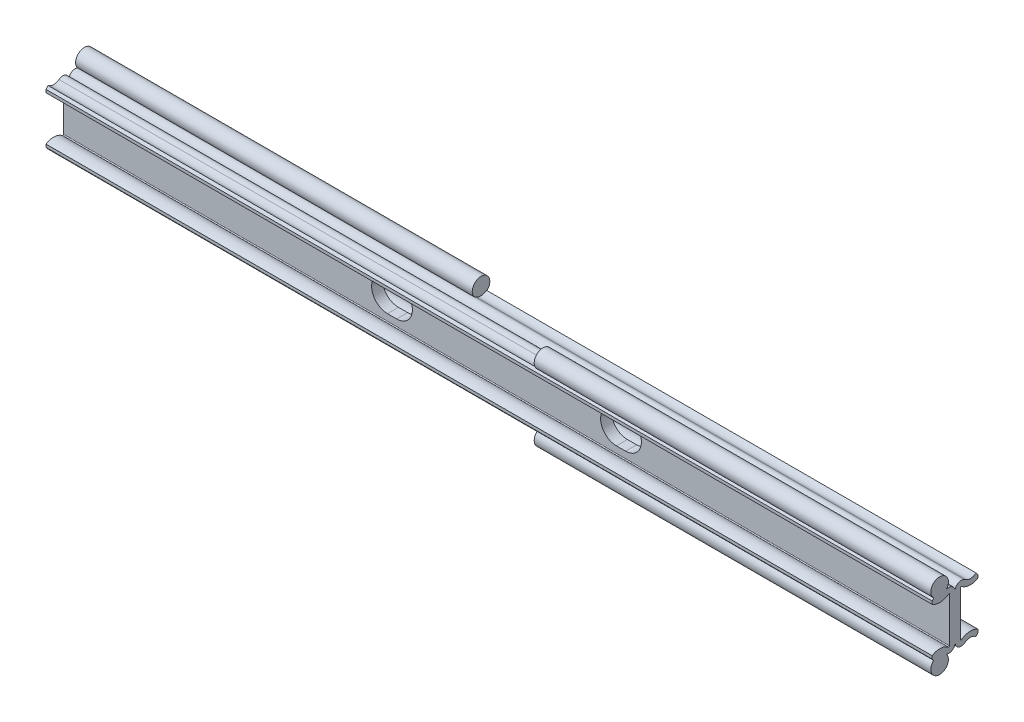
ISO-10303-21;
HEADER;
FILE_DESCRIPTION(('STEP AP214'),'2;1');
FILE_NAME('part.step','',(''),(''),'','','');
FILE_SCHEMA(('AUTOMOTIVE_DESIGN { 1 0 10303 214 1 1 1 1 }'));
ENDSEC;
DATA;
#1=APPLICATION_CONTEXT('core data for automotive mechanical design processes');
#2=APPLICATION_PROTOCOL_DEFINITION('international standard','automotive_design',2000,#1);
#3=PRODUCT_CONTEXT('',#1,'mechanical');
#4=PRODUCT('Part','Part','',(#3));
#5=PRODUCT_RELATED_PRODUCT_CATEGORY('part','',(#4));
#6=PRODUCT_DEFINITION_FORMATION('','',#4);
#7=PRODUCT_DEFINITION_CONTEXT('part definition',#1,'design');
#8=PRODUCT_DEFINITION('design','',#6,#7);
#9=PRODUCT_DEFINITION_SHAPE('','',#8);
#10=(LENGTH_UNIT() NAMED_UNIT(*) SI_UNIT(.MILLI.,.METRE.));
#11=(NAMED_UNIT(*) PLANE_ANGLE_UNIT() SI_UNIT($,.RADIAN.));
#12=(NAMED_UNIT(*) SI_UNIT($,.STERADIAN.) SOLID_ANGLE_UNIT());
#13=UNCERTAINTY_MEASURE_WITH_UNIT(LENGTH_MEASURE(1.E-05),#10,'distance_accuracy_value','');
#14=(GEOMETRIC_REPRESENTATION_CONTEXT(3) GLOBAL_UNCERTAINTY_ASSIGNED_CONTEXT((#13)) GLOBAL_UNIT_ASSIGNED_CONTEXT((#10,
#11,#12)) REPRESENTATION_CONTEXT('',''));
#15=CARTESIAN_POINT('',(0.,0.,0.));
#16=DIRECTION('',(0.,0.,1.));
#17=DIRECTION('',(1.,0.,0.));
#18=AXIS2_PLACEMENT_3D('',#15,#16,#17);
#19=CARTESIAN_POINT('',(-125.,9.67000022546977,4.31000011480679));
#20=DIRECTION('',(1.,0.,0.));
#21=DIRECTION('',(0.,0.,-1.));
#22=AXIS2_PLACEMENT_3D('',#19,#20,#21);
#23=CYLINDRICAL_SURFACE('',#22,2.48000011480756);
#24=CARTESIAN_POINT('',(13.1,9.67000022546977,4.31000011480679));
#25=DIRECTION('',(1.,0.,0.));
#26=DIRECTION('',(0.,0.,-1.));
#27=AXIS2_PLACEMENT_3D('',#24,#25,#26);
#28=CIRCLE('',#27,2.48000011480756);
#29=CARTESIAN_POINT('',(13.1,7.69573962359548,2.80910183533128));
#30=VERTEX_POINT('',#29);
#31=CARTESIAN_POINT('',(13.1,7.77020990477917,5.90411344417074));
#32=VERTEX_POINT('',#31);
#33=EDGE_CURVE('E323',#30,#32,#28,.F.);
#34=ORIENTED_EDGE('',*,*,#33,.F.);
#35=DIRECTION('',(1.,0.,0.));
#36=VECTOR('',#35,1.);
#37=CARTESIAN_POINT('',(-125.,7.69573962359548,2.80910183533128));
#38=LINE('',#37,#36);
#39=CARTESIAN_POINT('',(-125.,7.69573962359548,2.80910183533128));
#40=VERTEX_POINT('',#39);
#41=EDGE_CURVE('E545',#40,#30,#38,.T.);
#42=ORIENTED_EDGE('',*,*,#41,.F.);
#43=CARTESIAN_POINT('',(-125.,9.67000022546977,4.31000011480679));
#44=DIRECTION('',(1.,0.,0.));
#45=DIRECTION('',(0.,0.,-1.));
#46=AXIS2_PLACEMENT_3D('',#43,#44,#45);
#47=CIRCLE('',#46,2.48000011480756);
#48=CARTESIAN_POINT('',(-125.,7.77020990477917,5.90411344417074));
#49=VERTEX_POINT('',#48);
#50=EDGE_CURVE('E506',#49,#40,#47,.T.);
#51=ORIENTED_EDGE('',*,*,#50,.F.);
#52=DIRECTION('',(1.,0.,0.));
#53=VECTOR('',#52,1.);
#54=CARTESIAN_POINT('',(-125.,7.77020990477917,5.90411344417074));
#55=LINE('',#54,#53);
#56=EDGE_CURVE('E548',#49,#32,#55,.T.);
#57=ORIENTED_EDGE('',*,*,#56,.T.);
#58=EDGE_LOOP('',(#34,#42,#51,#57));
#59=FACE_BOUND('',#58,.T.);
#60=ADVANCED_FACE('F14',(#59),#23,.F.);
#61=CARTESIAN_POINT('',(-125.,9.67000022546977,-4.31000011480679));
#62=DIRECTION('',(1.,0.,0.));
#63=DIRECTION('',(0.,0.,-1.));
#64=AXIS2_PLACEMENT_3D('',#61,#62,#63);
#65=CYLINDRICAL_SURFACE('',#64,2.48000011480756);
#66=CARTESIAN_POINT('',(-13.1,9.67000022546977,-4.31000011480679));
#67=DIRECTION('',(-1.,0.,0.));
#68=DIRECTION('',(0.,0.,1.));
#69=AXIS2_PLACEMENT_3D('',#66,#67,#68);
#70=CIRCLE('',#69,2.48000011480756);
#71=CARTESIAN_POINT('',(-13.1,7.69573962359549,-2.80910183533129));
#72=VERTEX_POINT('',#71);
#73=CARTESIAN_POINT('',(-13.1,7.77020990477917,-5.90411344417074));
#74=VERTEX_POINT('',#73);
#75=EDGE_CURVE('E357',#72,#74,#70,.F.);
#76=ORIENTED_EDGE('',*,*,#75,.F.);
#77=DIRECTION('',(1.,0.,0.));
#78=VECTOR('',#77,1.);
#79=CARTESIAN_POINT('',(-125.,7.69573962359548,-2.80910183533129));
#80=LINE('',#79,#78);
#81=CARTESIAN_POINT('',(125.,7.69573962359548,-2.80910183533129));
#82=VERTEX_POINT('',#81);
#83=EDGE_CURVE('E540',#72,#82,#80,.T.);
#84=ORIENTED_EDGE('',*,*,#83,.T.);
#85=CARTESIAN_POINT('',(125.,9.67000022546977,-4.31000011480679));
#86=DIRECTION('',(1.,0.,0.));
#87=DIRECTION('',(0.,0.,1.));
#88=AXIS2_PLACEMENT_3D('',#85,#86,#87);
#89=CIRCLE('',#88,2.48000011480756);
#90=CARTESIAN_POINT('',(125.,7.77020990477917,-5.90411344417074));
#91=VERTEX_POINT('',#90);
#92=EDGE_CURVE('E459',#82,#91,#89,.T.);
#93=ORIENTED_EDGE('',*,*,#92,.T.);
#94=DIRECTION('',(1.,0.,0.));
#95=VECTOR('',#94,1.);
#96=CARTESIAN_POINT('',(-125.,7.77020990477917,-5.90411344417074));
#97=LINE('',#96,#95);
#98=EDGE_CURVE('E538',#74,#91,#97,.T.);
#99=ORIENTED_EDGE('',*,*,#98,.F.);
#100=EDGE_LOOP('',(#76,#84,#93,#99));
#101=FACE_BOUND('',#100,.T.);
#102=ADVANCED_FACE('F681',(#101),#65,.F.);
#103=CARTESIAN_POINT('',(-125.,-6.30261222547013,-1.75000011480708));
#104=DIRECTION('',(1.,0.,0.));
#105=DIRECTION('',(0.,0.,-1.));
#106=AXIS2_PLACEMENT_3D('',#103,#104,#105);
#107=CYLINDRICAL_SURFACE('',#106,0.200000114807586);
#108=CARTESIAN_POINT('',(125.,-6.30261222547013,-1.75000011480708));
#109=DIRECTION('',(1.,0.,0.));
#110=DIRECTION('',(0.,0.,-1.));
#111=AXIS2_PLACEMENT_3D('',#108,#109,#110);
#112=CIRCLE('',#111,0.200000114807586);
#113=CARTESIAN_POINT('',(125.,-6.30261222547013,-1.54999999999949));
#114=VERTEX_POINT('',#113);
#115=CARTESIAN_POINT('',(125.,-6.46182696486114,-1.87104024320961));
#116=VERTEX_POINT('',#115);
#117=EDGE_CURVE('E423',#114,#116,#112,.T.);
#118=ORIENTED_EDGE('',*,*,#117,.T.);
#119=DIRECTION('',(1.,0.,0.));
#120=VECTOR('',#119,1.);
#121=CARTESIAN_POINT('',(-125.,-6.46182696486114,-1.87104024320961));
#122=LINE('',#121,#120);
#123=CARTESIAN_POINT('',(-125.,-6.46182696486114,-1.87104024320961));
#124=VERTEX_POINT('',#123);
#125=EDGE_CURVE('E591',#124,#116,#122,.T.);
#126=ORIENTED_EDGE('',*,*,#125,.F.);
#127=CARTESIAN_POINT('',(-125.,-6.30261222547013,-1.75000011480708));
#128=DIRECTION('',(1.,0.,0.));
#129=DIRECTION('',(0.,0.,-1.));
#130=AXIS2_PLACEMENT_3D('',#127,#128,#129);
#131=CIRCLE('',#130,0.200000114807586);
#132=CARTESIAN_POINT('',(-125.,-6.30261222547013,-1.54999999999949));
#133=VERTEX_POINT('',#132);
#134=EDGE_CURVE('E472',#133,#124,#131,.T.);
#135=ORIENTED_EDGE('',*,*,#134,.F.);
#136=DIRECTION('',(1.,0.,0.));
#137=VECTOR('',#136,1.);
#138=CARTESIAN_POINT('',(-125.,-6.30261222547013,-1.54999999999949));
#139=LINE('',#138,#137);
#140=EDGE_CURVE('E523',#133,#114,#139,.T.);
#141=ORIENTED_EDGE('',*,*,#140,.T.);
#142=EDGE_LOOP('',(#118,#126,#135,#141));
#143=FACE_BOUND('',#142,.T.);
#144=ADVANCED_FACE('F16',(#143),#107,.F.);
#145=CARTESIAN_POINT('',(-125.,-9.67000022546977,-4.31000011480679));
#146=DIRECTION('',(1.,0.,0.));
#147=DIRECTION('',(0.,0.,-1.));
#148=AXIS2_PLACEMENT_3D('',#145,#146,#147);
#149=CYLINDRICAL_SURFACE('',#148,4.03000011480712);
#150=CARTESIAN_POINT('',(125.,-9.67000022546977,-4.31000011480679));
#151=DIRECTION('',(-1.,0.,0.));
#152=DIRECTION('',(0.,0.,-1.));
#153=AXIS2_PLACEMENT_3D('',#150,#151,#152);
#154=CIRCLE('',#153,4.03000011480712);
#155=CARTESIAN_POINT('',(125.,-6.26775086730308,-6.47000016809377));
#156=VERTEX_POINT('',#155);
#157=EDGE_CURVE('E426',#116,#156,#154,.T.);
#158=ORIENTED_EDGE('',*,*,#157,.T.);
#159=DIRECTION('',(1.,0.,0.));
#160=VECTOR('',#159,1.);
#161=CARTESIAN_POINT('',(-125.,-6.26775086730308,-6.47000016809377));
#162=LINE('',#161,#160);
#163=CARTESIAN_POINT('',(-125.,-6.26775086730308,-6.47000016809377));
#164=VERTEX_POINT('',#163);
#165=EDGE_CURVE('E588',#164,#156,#162,.T.);
#166=ORIENTED_EDGE('',*,*,#165,.F.);
#167=CARTESIAN_POINT('',(-125.,-9.67000022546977,-4.31000011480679));
#168=DIRECTION('',(-1.,0.,0.));
#169=DIRECTION('',(0.,0.,-1.));
#170=AXIS2_PLACEMENT_3D('',#167,#168,#169);
#171=CIRCLE('',#170,4.03000011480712);
#172=EDGE_CURVE('E475',#124,#164,#171,.T.);
#173=ORIENTED_EDGE('',*,*,#172,.F.);
#174=ORIENTED_EDGE('',*,*,#125,.T.);
#175=EDGE_LOOP('',(#158,#166,#173,#174));
#176=FACE_BOUND('',#175,.T.);
#177=ADVANCED_FACE('F729',(#176),#149,.T.);
#178=CARTESIAN_POINT('',(-125.,-6.26775086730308,-6.47000016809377));
#179=DIRECTION('',(0.,0.,1.));
#180=DIRECTION('',(1.,0.,0.));
#181=AXIS2_PLACEMENT_3D('',#178,#179,#180);
#182=PLANE('',#181);
#183=DIRECTION('',(0.,-1.,0.));
#184=VECTOR('',#183,1.);
#185=CARTESIAN_POINT('',(125.,-6.26775086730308,-6.47000016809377));
#186=LINE('',#185,#184);
#187=CARTESIAN_POINT('',(125.,-7.09581212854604,-6.47000016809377));
#188=VERTEX_POINT('',#187);
#189=EDGE_CURVE('E428',#156,#188,#186,.T.);
#190=ORIENTED_EDGE('',*,*,#189,.T.);
#191=DIRECTION('',(1.,0.,0.));
#192=VECTOR('',#191,1.);
#193=CARTESIAN_POINT('',(-125.,-7.09581212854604,-6.47000016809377));
#194=LINE('',#193,#192);
#195=CARTESIAN_POINT('',(-125.,-7.09581212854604,-6.47000016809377));
#196=VERTEX_POINT('',#195);
#197=EDGE_CURVE('E585',#196,#188,#194,.T.);
#198=ORIENTED_EDGE('',*,*,#197,.F.);
#199=DIRECTION('',(0.,-1.,0.));
#200=VECTOR('',#199,1.);
#201=CARTESIAN_POINT('',(-125.,-6.26775086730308,-6.47000016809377));
#202=LINE('',#201,#200);
#203=EDGE_CURVE('E477',#164,#196,#202,.T.);
#204=ORIENTED_EDGE('',*,*,#203,.F.);
#205=ORIENTED_EDGE('',*,*,#165,.T.);
#206=EDGE_LOOP('',(#190,#198,#204,#205));
#207=FACE_BOUND('',#206,.T.);
#208=ADVANCED_FACE('F726',(#207),#182,.F.);
#209=CARTESIAN_POINT('',(-125.,-7.77020990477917,-5.90411344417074));
#210=DIRECTION('',(0.,0.642787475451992,0.766044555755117));
#211=DIRECTION('',(0.,0.766044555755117,-0.642787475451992));
#212=AXIS2_PLACEMENT_3D('',#209,#210,#211);
#213=PLANE('',#212);
#214=DIRECTION('',(0.,0.766044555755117,-0.642787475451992));
#215=VECTOR('',#214,1.);
#216=CARTESIAN_POINT('',(-13.1,-7.77020990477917,-5.90411344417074));
#217=LINE('',#216,#215);
#218=CARTESIAN_POINT('',(-13.1,-7.77020990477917,-5.90411344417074));
#219=VERTEX_POINT('',#218);
#220=CARTESIAN_POINT('',(-13.1,-7.62948341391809,-6.02219694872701));
#221=VERTEX_POINT('',#220);
#222=EDGE_CURVE('E343',#219,#221,#217,.T.);
#223=ORIENTED_EDGE('',*,*,#222,.T.);
#224=DIRECTION('',(-1.,0.,0.));
#225=VECTOR('',#224,1.);
#226=CARTESIAN_POINT('',(-13.1,-7.62948341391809,-6.02219694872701));
#227=LINE('',#226,#225);
#228=CARTESIAN_POINT('',(-125.,-7.62948341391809,-6.02219694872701));
#229=VERTEX_POINT('',#228);
#230=EDGE_CURVE('E337',#221,#229,#227,.T.);
#231=ORIENTED_EDGE('',*,*,#230,.T.);
#232=DIRECTION('',(0.,-0.766044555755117,0.642787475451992));
#233=VECTOR('',#232,1.);
#234=CARTESIAN_POINT('',(-125.,-7.77020990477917,-5.90411344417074));
#235=LINE('',#234,#233);
#236=EDGE_CURVE('E479',#196,#229,#235,.T.);
#237=ORIENTED_EDGE('',*,*,#236,.F.);
#238=ORIENTED_EDGE('',*,*,#197,.T.);
#239=DIRECTION('',(0.,-0.766044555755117,0.642787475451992));
#240=VECTOR('',#239,1.);
#241=CARTESIAN_POINT('',(125.,-7.77020990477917,-5.90411344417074));
#242=LINE('',#241,#240);
#243=CARTESIAN_POINT('',(125.,-7.77020990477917,-5.90411344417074));
#244=VERTEX_POINT('',#243);
#245=EDGE_CURVE('E430',#188,#244,#242,.T.);
#246=ORIENTED_EDGE('',*,*,#245,.T.);
#247=DIRECTION('',(1.,0.,0.));
#248=VECTOR('',#247,1.);
#249=CARTESIAN_POINT('',(-125.,-7.77020990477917,-5.90411344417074));
#250=LINE('',#249,#248);
#251=EDGE_CURVE('E583',#219,#244,#250,.T.);
#252=ORIENTED_EDGE('',*,*,#251,.F.);
#253=EDGE_LOOP('',(#223,#231,#237,#238,#246,#252));
#254=FACE_BOUND('',#253,.T.);
#255=ADVANCED_FACE('F722',(#254),#213,.F.);
#256=CARTESIAN_POINT('',(-125.,-9.67000022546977,-4.31000011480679));
#257=DIRECTION('',(1.,0.,0.));
#258=DIRECTION('',(0.,0.,-1.));
#259=AXIS2_PLACEMENT_3D('',#256,#257,#258);
#260=CYLINDRICAL_SURFACE('',#259,2.48000011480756);
#261=DIRECTION('',(1.,0.,0.));
#262=VECTOR('',#261,1.);
#263=CARTESIAN_POINT('',(-125.,-7.69573962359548,-2.80910183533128));
#264=LINE('',#263,#262);
#265=CARTESIAN_POINT('',(-13.1,-7.69573962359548,-2.80910183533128));
#266=VERTEX_POINT('',#265);
#267=CARTESIAN_POINT('',(125.,-7.69573962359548,-2.80910183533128));
#268=VERTEX_POINT('',#267);
#269=EDGE_CURVE('E581',#266,#268,#264,.T.);
#270=ORIENTED_EDGE('',*,*,#269,.F.);
#271=CARTESIAN_POINT('',(-13.1,-9.67000022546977,-4.31000011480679));
#272=DIRECTION('',(1.,0.,0.));
#273=DIRECTION('',(0.,0.,-1.));
#274=AXIS2_PLACEMENT_3D('',#271,#272,#273);
#275=CIRCLE('',#274,2.48000011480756);
#276=EDGE_CURVE('E340',#266,#219,#275,.F.);
#277=ORIENTED_EDGE('',*,*,#276,.T.);
#278=ORIENTED_EDGE('',*,*,#251,.T.);
#279=CARTESIAN_POINT('',(125.,-9.67000022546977,-4.31000011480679));
#280=DIRECTION('',(1.,0.,0.));
#281=DIRECTION('',(0.,0.,-1.));
#282=AXIS2_PLACEMENT_3D('',#279,#280,#281);
#283=CIRCLE('',#282,2.48000011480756);
#284=EDGE_CURVE('E433',#244,#268,#283,.T.);
#285=ORIENTED_EDGE('',*,*,#284,.T.);
#286=EDGE_LOOP('',(#270,#277,#278,#285));
#287=FACE_BOUND('',#286,.T.);
#288=ADVANCED_FACE('F718',(#287),#260,.F.);
#289=CARTESIAN_POINT('',(-125.,-6.30261222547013,-1.75000011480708));
#290=DIRECTION('',(1.,0.,0.));
#291=DIRECTION('',(0.,0.,-1.));
#292=AXIS2_PLACEMENT_3D('',#289,#290,#291);
#293=CYLINDRICAL_SURFACE('',#292,1.75000011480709);
#294=CARTESIAN_POINT('',(-125.,-6.30261222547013,-1.75000011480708));
#295=DIRECTION('',(-1.,0.,0.));
#296=DIRECTION('',(0.,0.,-1.));
#297=AXIS2_PLACEMENT_3D('',#294,#295,#296);
#298=CIRCLE('',#297,1.75000011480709);
#299=CARTESIAN_POINT('',(-125.,-7.91637379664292,-2.42695948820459));
#300=VERTEX_POINT('',#299);
#301=CARTESIAN_POINT('',(-125.,-6.30261222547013,0.));
#302=VERTEX_POINT('',#301);
#303=EDGE_CURVE('E482',#300,#302,#298,.T.);
#304=ORIENTED_EDGE('',*,*,#303,.F.);
#305=DIRECTION('',(-1.,0.,0.));
#306=VECTOR('',#305,1.);
#307=CARTESIAN_POINT('',(-69.05,-7.91637379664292,-2.42695948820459));
#308=LINE('',#307,#306);
#309=CARTESIAN_POINT('',(-13.1,-7.91637379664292,-2.42695948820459));
#310=VERTEX_POINT('',#309);
#311=EDGE_CURVE('E333',#300,#310,#308,.F.);
#312=ORIENTED_EDGE('',*,*,#311,.T.);
#313=CARTESIAN_POINT('',(-13.1,-6.30261222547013,-1.75000011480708));
#314=DIRECTION('',(1.,0.,0.));
#315=DIRECTION('',(0.,0.,-1.));
#316=AXIS2_PLACEMENT_3D('',#313,#314,#315);
#317=CIRCLE('',#316,1.75000011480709);
#318=EDGE_CURVE('E596',#310,#266,#317,.T.);
#319=ORIENTED_EDGE('',*,*,#318,.T.);
#320=ORIENTED_EDGE('',*,*,#269,.T.);
#321=CARTESIAN_POINT('',(125.,-6.30261222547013,-1.75000011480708));
#322=DIRECTION('',(-1.,0.,0.));
#323=DIRECTION('',(0.,0.,-1.));
#324=AXIS2_PLACEMENT_3D('',#321,#322,#323);
#325=CIRCLE('',#324,1.75000011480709);
#326=CARTESIAN_POINT('',(125.,-6.30261222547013,0.));
#327=VERTEX_POINT('',#326);
#328=EDGE_CURVE('E436',#268,#327,#325,.T.);
#329=ORIENTED_EDGE('',*,*,#328,.T.);
#330=DIRECTION('',(1.,0.,0.));
#331=VECTOR('',#330,1.);
#332=CARTESIAN_POINT('',(-125.,-6.30261222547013,0.));
#333=LINE('',#332,#331);
#334=EDGE_CURVE('E578',#302,#327,#333,.T.);
#335=ORIENTED_EDGE('',*,*,#334,.F.);
#336=EDGE_LOOP('',(#304,#312,#319,#320,#329,#335));
#337=FACE_BOUND('',#336,.T.);
#338=ADVANCED_FACE('F715',(#337),#293,.T.);
#339=CARTESIAN_POINT('',(-125.,-6.30261222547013,1.75000011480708));
#340=DIRECTION('',(1.,0.,0.));
#341=DIRECTION('',(0.,0.,-1.));
#342=AXIS2_PLACEMENT_3D('',#339,#340,#341);
#343=CYLINDRICAL_SURFACE('',#342,1.75000011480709);
#344=CARTESIAN_POINT('',(125.,-6.30261222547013,1.75000011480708));
#345=DIRECTION('',(-1.,0.,0.));
#346=DIRECTION('',(0.,0.,1.));
#347=AXIS2_PLACEMENT_3D('',#344,#345,#346);
#348=CIRCLE('',#347,1.75000011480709);
#349=CARTESIAN_POINT('',(125.,-7.91637379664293,2.42695948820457));
#350=VERTEX_POINT('',#349);
#351=EDGE_CURVE('E292',#327,#350,#348,.T.);
#352=ORIENTED_EDGE('',*,*,#351,.T.);
#353=DIRECTION('',(1.,0.,0.));
#354=VECTOR('',#353,1.);
#355=CARTESIAN_POINT('',(69.05,-7.91637379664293,2.42695948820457));
#356=LINE('',#355,#354);
#357=CARTESIAN_POINT('',(13.1,-7.91637379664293,2.42695948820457));
#358=VERTEX_POINT('',#357);
#359=EDGE_CURVE('E29',#350,#358,#356,.F.);
#360=ORIENTED_EDGE('',*,*,#359,.T.);
#361=CARTESIAN_POINT('',(13.1,-6.30261222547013,1.75000011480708));
#362=DIRECTION('',(-1.,0.,0.));
#363=DIRECTION('',(0.,0.,1.));
#364=AXIS2_PLACEMENT_3D('',#361,#362,#363);
#365=CIRCLE('',#364,1.75000011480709);
#366=CARTESIAN_POINT('',(13.1,-7.69573962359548,2.80910183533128));
#367=VERTEX_POINT('',#366);
#368=EDGE_CURVE('E33',#358,#367,#365,.T.);
#369=ORIENTED_EDGE('',*,*,#368,.T.);
#370=DIRECTION('',(1.,0.,0.));
#371=VECTOR('',#370,1.);
#372=CARTESIAN_POINT('',(-125.,-7.69573962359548,2.80910183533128));
#373=LINE('',#372,#371);
#374=CARTESIAN_POINT('',(-125.,-7.69573962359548,2.80910183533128));
#375=VERTEX_POINT('',#374);
#376=EDGE_CURVE('E576',#375,#367,#373,.T.);
#377=ORIENTED_EDGE('',*,*,#376,.F.);
#378=CARTESIAN_POINT('',(-125.,-6.30261222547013,1.75000011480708));
#379=DIRECTION('',(-1.,0.,0.));
#380=DIRECTION('',(0.,0.,1.));
#381=AXIS2_PLACEMENT_3D('',#378,#379,#380);
#382=CIRCLE('',#381,1.75000011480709);
#383=EDGE_CURVE('E484',#302,#375,#382,.T.);
#384=ORIENTED_EDGE('',*,*,#383,.F.);
#385=ORIENTED_EDGE('',*,*,#334,.T.);
#386=EDGE_LOOP('',(#352,#360,#369,#377,#384,#385));
#387=FACE_BOUND('',#386,.T.);
#388=ADVANCED_FACE('F712',(#387),#343,.T.);
#389=CARTESIAN_POINT('',(-125.,-9.67000022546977,4.31000011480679));
#390=DIRECTION('',(1.,0.,0.));
#391=DIRECTION('',(0.,0.,-1.));
#392=AXIS2_PLACEMENT_3D('',#389,#390,#391);
#393=CYLINDRICAL_SURFACE('',#392,2.48000011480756);
#394=ORIENTED_EDGE('',*,*,#376,.T.);
#395=CARTESIAN_POINT('',(13.1,-9.67000022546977,4.31000011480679));
#396=DIRECTION('',(-1.,0.,0.));
#397=DIRECTION('',(0.,0.,1.));
#398=AXIS2_PLACEMENT_3D('',#395,#396,#397);
#399=CIRCLE('',#398,2.48000011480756);
#400=CARTESIAN_POINT('',(13.1,-7.77020990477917,5.90411344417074));
#401=VERTEX_POINT('',#400);
#402=EDGE_CURVE('E309',#367,#401,#399,.F.);
#403=ORIENTED_EDGE('',*,*,#402,.T.);
#404=DIRECTION('',(1.,0.,0.));
#405=VECTOR('',#404,1.);
#406=CARTESIAN_POINT('',(-125.,-7.77020990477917,5.90411344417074));
#407=LINE('',#406,#405);
#408=CARTESIAN_POINT('',(-125.,-7.77020990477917,5.90411344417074));
#409=VERTEX_POINT('',#408);
#410=EDGE_CURVE('E574',#409,#401,#407,.T.);
#411=ORIENTED_EDGE('',*,*,#410,.F.);
#412=CARTESIAN_POINT('',(-125.,-9.67000022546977,4.31000011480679));
#413=DIRECTION('',(1.,0.,0.));
#414=DIRECTION('',(0.,0.,1.));
#415=AXIS2_PLACEMENT_3D('',#412,#413,#414);
#416=CIRCLE('',#415,2.48000011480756);
#417=EDGE_CURVE('E486',#375,#409,#416,.T.);
#418=ORIENTED_EDGE('',*,*,#417,.F.);
#419=EDGE_LOOP('',(#394,#403,#411,#418));
#420=FACE_BOUND('',#419,.T.);
#421=ADVANCED_FACE('F667',(#420),#393,.F.);
#422=CARTESIAN_POINT('',(-125.,-7.77020990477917,5.90411344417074));
#423=DIRECTION('',(0.,0.642787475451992,-0.766044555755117));
#424=DIRECTION('',(0.,-0.766044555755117,-0.642787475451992));
#425=AXIS2_PLACEMENT_3D('',#422,#423,#424);
#426=PLANE('',#425);
#427=DIRECTION('',(0.,0.766044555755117,0.642787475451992));
#428=VECTOR('',#427,1.);
#429=CARTESIAN_POINT('',(13.1,-7.77020990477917,5.90411344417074));
#430=LINE('',#429,#428);
#431=CARTESIAN_POINT('',(13.1,-7.62948341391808,6.02219694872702));
#432=VERTEX_POINT('',#431);
#433=EDGE_CURVE('E9',#401,#432,#430,.T.);
#434=ORIENTED_EDGE('',*,*,#433,.T.);
#435=DIRECTION('',(1.,0.,0.));
#436=VECTOR('',#435,1.);
#437=CARTESIAN_POINT('',(13.1,-7.62948341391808,6.02219694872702));
#438=LINE('',#437,#436);
#439=CARTESIAN_POINT('',(125.,-7.62948341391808,6.02219694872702));
#440=VERTEX_POINT('',#439);
#441=EDGE_CURVE('E295',#432,#440,#438,.T.);
#442=ORIENTED_EDGE('',*,*,#441,.T.);
#443=DIRECTION('',(0.,0.766044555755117,0.642787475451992));
#444=VECTOR('',#443,1.);
#445=CARTESIAN_POINT('',(125.,-7.77020990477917,5.90411344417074));
#446=LINE('',#445,#444);
#447=CARTESIAN_POINT('',(125.,-7.09581212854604,6.47000016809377));
#448=VERTEX_POINT('',#447);
#449=EDGE_CURVE('E281',#440,#448,#446,.T.);
#450=ORIENTED_EDGE('',*,*,#449,.T.);
#451=DIRECTION('',(1.,0.,0.));
#452=VECTOR('',#451,1.);
#453=CARTESIAN_POINT('',(-125.,-7.09581212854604,6.47000016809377));
#454=LINE('',#453,#452);
#455=CARTESIAN_POINT('',(-125.,-7.09581212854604,6.47000016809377));
#456=VERTEX_POINT('',#455);
#457=EDGE_CURVE('E572',#456,#448,#454,.T.);
#458=ORIENTED_EDGE('',*,*,#457,.F.);
#459=DIRECTION('',(0.,0.766044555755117,0.642787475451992));
#460=VECTOR('',#459,1.);
#461=CARTESIAN_POINT('',(-125.,-7.77020990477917,5.90411344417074));
#462=LINE('',#461,#460);
#463=EDGE_CURVE('E488',#409,#456,#462,.T.);
#464=ORIENTED_EDGE('',*,*,#463,.F.);
#465=ORIENTED_EDGE('',*,*,#410,.T.);
#466=EDGE_LOOP('',(#434,#442,#450,#458,#464,#465));
#467=FACE_BOUND('',#466,.T.);
#468=ADVANCED_FACE('F296',(#467),#426,.F.);
#469=CARTESIAN_POINT('',(-125.,-6.26775086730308,6.47000016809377));
#470=DIRECTION('',(0.,0.,-1.));
#471=DIRECTION('',(-1.,0.,0.));
#472=AXIS2_PLACEMENT_3D('',#469,#470,#471);
#473=PLANE('',#472);
#474=DIRECTION('',(0.,1.,0.));
#475=VECTOR('',#474,1.);
#476=CARTESIAN_POINT('',(125.,-6.26775086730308,6.47000016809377));
#477=LINE('',#476,#475);
#478=CARTESIAN_POINT('',(125.,-6.26775086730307,6.47000016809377));
#479=VERTEX_POINT('',#478);
#480=EDGE_CURVE('E288',#448,#479,#477,.T.);
#481=ORIENTED_EDGE('',*,*,#480,.T.);
#482=DIRECTION('',(1.,0.,0.));
#483=VECTOR('',#482,1.);
#484=CARTESIAN_POINT('',(-125.,-6.26775086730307,6.47000016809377));
#485=LINE('',#484,#483);
#486=CARTESIAN_POINT('',(-125.,-6.26775086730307,6.47000016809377));
#487=VERTEX_POINT('',#486);
#488=EDGE_CURVE('E569',#487,#479,#485,.T.);
#489=ORIENTED_EDGE('',*,*,#488,.F.);
#490=DIRECTION('',(0.,1.,0.));
#491=VECTOR('',#490,1.);
#492=CARTESIAN_POINT('',(-125.,-6.26775086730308,6.47000016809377));
#493=LINE('',#492,#491);
#494=EDGE_CURVE('E490',#456,#487,#493,.T.);
#495=ORIENTED_EDGE('',*,*,#494,.F.);
#496=ORIENTED_EDGE('',*,*,#457,.T.);
#497=EDGE_LOOP('',(#481,#489,#495,#496));
#498=FACE_BOUND('',#497,.T.);
#499=ADVANCED_FACE('F661',(#498),#473,.F.);
#500=CARTESIAN_POINT('',(-125.,-9.67000022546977,4.31000011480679));
#501=DIRECTION('',(1.,0.,0.));
#502=DIRECTION('',(0.,0.,-1.));
#503=AXIS2_PLACEMENT_3D('',#500,#501,#502);
#504=CYLINDRICAL_SURFACE('',#503,4.03000011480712);
#505=CARTESIAN_POINT('',(125.,-9.67000022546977,4.31000011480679));
#506=DIRECTION('',(-1.,0.,0.));
#507=DIRECTION('',(0.,0.,1.));
#508=AXIS2_PLACEMENT_3D('',#505,#506,#507);
#509=CIRCLE('',#508,4.03000011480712);
#510=CARTESIAN_POINT('',(125.,-6.46182696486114,1.87104024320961));
#511=VERTEX_POINT('',#510);
#512=EDGE_CURVE('E440',#479,#511,#509,.T.);
#513=ORIENTED_EDGE('',*,*,#512,.T.);
#514=DIRECTION('',(1.,0.,0.));
#515=VECTOR('',#514,1.);
#516=CARTESIAN_POINT('',(-125.,-6.46182696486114,1.87104024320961));
#517=LINE('',#516,#515);
#518=CARTESIAN_POINT('',(-125.,-6.46182696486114,1.87104024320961));
#519=VERTEX_POINT('',#518);
#520=EDGE_CURVE('E566',#519,#511,#517,.T.);
#521=ORIENTED_EDGE('',*,*,#520,.F.);
#522=CARTESIAN_POINT('',(-125.,-9.67000022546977,4.31000011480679));
#523=DIRECTION('',(-1.,0.,0.));
#524=DIRECTION('',(0.,0.,1.));
#525=AXIS2_PLACEMENT_3D('',#522,#523,#524);
#526=CIRCLE('',#525,4.03000011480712);
#527=EDGE_CURVE('E492',#487,#519,#526,.T.);
#528=ORIENTED_EDGE('',*,*,#527,.F.);
#529=ORIENTED_EDGE('',*,*,#488,.T.);
#530=EDGE_LOOP('',(#513,#521,#528,#529));
#531=FACE_BOUND('',#530,.T.);
#532=ADVANCED_FACE('F657',(#531),#504,.T.);
#533=CARTESIAN_POINT('',(-125.,-6.30261222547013,1.75000011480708));
#534=DIRECTION('',(1.,0.,0.));
#535=DIRECTION('',(0.,0.,-1.));
#536=AXIS2_PLACEMENT_3D('',#533,#534,#535);
#537=CYLINDRICAL_SURFACE('',#536,0.200000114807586);
#538=CARTESIAN_POINT('',(125.,-6.30261222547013,1.75000011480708));
#539=DIRECTION('',(1.,0.,0.));
#540=DIRECTION('',(0.,0.,1.));
#541=AXIS2_PLACEMENT_3D('',#538,#539,#540);
#542=CIRCLE('',#541,0.200000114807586);
#543=CARTESIAN_POINT('',(125.,-6.30261222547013,1.54999999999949));
#544=VERTEX_POINT('',#543);
#545=EDGE_CURVE('E442',#511,#544,#542,.T.);
#546=ORIENTED_EDGE('',*,*,#545,.T.);
#547=DIRECTION('',(1.,0.,0.));
#548=VECTOR('',#547,1.);
#549=CARTESIAN_POINT('',(-125.,-6.30261222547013,1.54999999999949));
#550=LINE('',#549,#548);
#551=CARTESIAN_POINT('',(-125.,-6.30261222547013,1.54999999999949));
#552=VERTEX_POINT('',#551);
#553=EDGE_CURVE('E563',#552,#544,#550,.T.);
#554=ORIENTED_EDGE('',*,*,#553,.F.);
#555=CARTESIAN_POINT('',(-125.,-6.30261222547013,1.75000011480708));
#556=DIRECTION('',(1.,0.,0.));
#557=DIRECTION('',(0.,0.,1.));
#558=AXIS2_PLACEMENT_3D('',#555,#556,#557);
#559=CIRCLE('',#558,0.200000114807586);
#560=EDGE_CURVE('E494',#519,#552,#559,.T.);
#561=ORIENTED_EDGE('',*,*,#560,.F.);
#562=ORIENTED_EDGE('',*,*,#520,.T.);
#563=EDGE_LOOP('',(#546,#554,#561,#562));
#564=FACE_BOUND('',#563,.T.);
#565=ADVANCED_FACE('F652',(#564),#537,.F.);
#566=CARTESIAN_POINT('',(-125.,-6.30261222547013,1.54999999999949));
#567=DIRECTION('',(0.,0.,-1.));
#568=DIRECTION('',(-1.,0.,0.));
#569=AXIS2_PLACEMENT_3D('',#566,#567,#568);
#570=PLANE('',#569);
#571=DIRECTION('',(1.,0.,0.));
#572=VECTOR('',#571,1.);
#573=CARTESIAN_POINT('',(-31.,-4.45,1.54999999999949));
#574=LINE('',#573,#572);
#575=CARTESIAN_POINT('',(-33.6,-4.45,1.54999999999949));
#576=VERTEX_POINT('',#575);
#577=CARTESIAN_POINT('',(-31.,-4.45,1.54999999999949));
#578=VERTEX_POINT('',#577);
#579=EDGE_CURVE('E371',#576,#578,#574,.T.);
#580=ORIENTED_EDGE('',*,*,#579,.F.);
#581=CARTESIAN_POINT('',(-33.6,0.,1.54999999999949));
#582=DIRECTION('',(0.,0.,1.));
#583=DIRECTION('',(-1.,0.,0.));
#584=AXIS2_PLACEMENT_3D('',#581,#582,#583);
#585=CIRCLE('',#584,4.45);
#586=CARTESIAN_POINT('',(-33.6,4.45,1.54999999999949));
#587=VERTEX_POINT('',#586);
#588=EDGE_CURVE('E369',#587,#576,#585,.T.);
#589=ORIENTED_EDGE('',*,*,#588,.F.);
#590=DIRECTION('',(-1.,0.,0.));
#591=VECTOR('',#590,1.);
#592=CARTESIAN_POINT('',(-33.6,4.45,1.54999999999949));
#593=LINE('',#592,#591);
#594=CARTESIAN_POINT('',(-31.,4.45,1.54999999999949));
#595=VERTEX_POINT('',#594);
#596=EDGE_CURVE('E377',#595,#587,#593,.T.);
#597=ORIENTED_EDGE('',*,*,#596,.F.);
#598=CARTESIAN_POINT('',(-31.,0.,1.54999999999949));
#599=DIRECTION('',(0.,0.,1.));
#600=DIRECTION('',(-1.,0.,0.));
#601=AXIS2_PLACEMENT_3D('',#598,#599,#600);
#602=CIRCLE('',#601,4.45);
#603=EDGE_CURVE('E374',#578,#595,#602,.T.);
#604=ORIENTED_EDGE('',*,*,#603,.F.);
#605=EDGE_LOOP('',(#580,#589,#597,#604));
#606=FACE_BOUND('',#605,.T.);
#607=DIRECTION('',(1.,0.,0.));
#608=VECTOR('',#607,1.);
#609=CARTESIAN_POINT('',(31.,-4.45,1.54999999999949));
#610=LINE('',#609,#608);
#611=CARTESIAN_POINT('',(31.,-4.45,1.54999999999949));
#612=VERTEX_POINT('',#611);
#613=CARTESIAN_POINT('',(33.6,-4.45,1.54999999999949));
#614=VERTEX_POINT('',#613);
#615=EDGE_CURVE('E402',#612,#614,#610,.T.);
#616=ORIENTED_EDGE('',*,*,#615,.F.);
#617=CARTESIAN_POINT('',(31.,0.,1.54999999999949));
#618=DIRECTION('',(0.,0.,1.));
#619=DIRECTION('',(1.,0.,0.));
#620=AXIS2_PLACEMENT_3D('',#617,#618,#619);
#621=CIRCLE('',#620,4.45);
#622=CARTESIAN_POINT('',(31.,4.45,1.54999999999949));
#623=VERTEX_POINT('',#622);
#624=EDGE_CURVE('E400',#623,#612,#621,.T.);
#625=ORIENTED_EDGE('',*,*,#624,.F.);
#626=DIRECTION('',(-1.,0.,0.));
#627=VECTOR('',#626,1.);
#628=CARTESIAN_POINT('',(33.6,4.45,1.54999999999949));
#629=LINE('',#628,#627);
#630=CARTESIAN_POINT('',(33.6,4.45,1.54999999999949));
#631=VERTEX_POINT('',#630);
#632=EDGE_CURVE('E408',#631,#623,#629,.T.);
#633=ORIENTED_EDGE('',*,*,#632,.F.);
#634=CARTESIAN_POINT('',(33.6,0.,1.54999999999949));
#635=DIRECTION('',(0.,0.,1.));
#636=DIRECTION('',(1.,0.,0.));
#637=AXIS2_PLACEMENT_3D('',#634,#635,#636);
#638=CIRCLE('',#637,4.45);
#639=EDGE_CURVE('E405',#614,#631,#638,.T.);
#640=ORIENTED_EDGE('',*,*,#639,.F.);
#641=EDGE_LOOP('',(#616,#625,#633,#640));
#642=FACE_BOUND('',#641,.T.);
#643=DIRECTION('',(0.,1.,0.));
#644=VECTOR('',#643,1.);
#645=CARTESIAN_POINT('',(125.,-6.30261222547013,1.54999999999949));
#646=LINE('',#645,#644);
#647=CARTESIAN_POINT('',(125.,6.30261222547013,1.54999999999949));
#648=VERTEX_POINT('',#647);
#649=EDGE_CURVE('E444',#544,#648,#646,.T.);
#650=ORIENTED_EDGE('',*,*,#649,.T.);
#651=DIRECTION('',(1.,0.,0.));
#652=VECTOR('',#651,1.);
#653=CARTESIAN_POINT('',(-125.,6.30261222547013,1.54999999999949));
#654=LINE('',#653,#652);
#655=CARTESIAN_POINT('',(-125.,6.30261222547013,1.54999999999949));
#656=VERTEX_POINT('',#655);
#657=EDGE_CURVE('E560',#656,#648,#654,.T.);
#658=ORIENTED_EDGE('',*,*,#657,.F.);
#659=DIRECTION('',(0.,1.,0.));
#660=VECTOR('',#659,1.);
#661=CARTESIAN_POINT('',(-125.,-6.30261222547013,1.54999999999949));
#662=LINE('',#661,#660);
#663=EDGE_CURVE('E496',#552,#656,#662,.T.);
#664=ORIENTED_EDGE('',*,*,#663,.F.);
#665=ORIENTED_EDGE('',*,*,#553,.T.);
#666=EDGE_LOOP('',(#650,#658,#664,#665));
#667=FACE_BOUND('',#666,.T.);
#668=ADVANCED_FACE('F648',(#606,#642,#667),#570,.F.);
#669=CARTESIAN_POINT('',(-125.,6.30261222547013,1.75000011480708));
#670=DIRECTION('',(1.,0.,0.));
#671=DIRECTION('',(0.,0.,-1.));
#672=AXIS2_PLACEMENT_3D('',#669,#670,#671);
#673=CYLINDRICAL_SURFACE('',#672,0.200000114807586);
#674=CARTESIAN_POINT('',(125.,6.30261222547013,1.75000011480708));
#675=DIRECTION('',(1.,0.,0.));
#676=DIRECTION('',(0.,0.,-1.));
#677=AXIS2_PLACEMENT_3D('',#674,#675,#676);
#678=CIRCLE('',#677,0.200000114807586);
#679=CARTESIAN_POINT('',(125.,6.46182696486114,1.87104024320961));
#680=VERTEX_POINT('',#679);
#681=EDGE_CURVE('E446',#648,#680,#678,.T.);
#682=ORIENTED_EDGE('',*,*,#681,.T.);
#683=DIRECTION('',(1.,0.,0.));
#684=VECTOR('',#683,1.);
#685=CARTESIAN_POINT('',(-125.,6.46182696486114,1.87104024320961));
#686=LINE('',#685,#684);
#687=CARTESIAN_POINT('',(-125.,6.46182696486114,1.87104024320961));
#688=VERTEX_POINT('',#687);
#689=EDGE_CURVE('E557',#688,#680,#686,.T.);
#690=ORIENTED_EDGE('',*,*,#689,.F.);
#691=CARTESIAN_POINT('',(-125.,6.30261222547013,1.75000011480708));
#692=DIRECTION('',(1.,0.,0.));
#693=DIRECTION('',(0.,0.,-1.));
#694=AXIS2_PLACEMENT_3D('',#691,#692,#693);
#695=CIRCLE('',#694,0.200000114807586);
#696=EDGE_CURVE('E498',#656,#688,#695,.T.);
#697=ORIENTED_EDGE('',*,*,#696,.F.);
#698=ORIENTED_EDGE('',*,*,#657,.T.);
#699=EDGE_LOOP('',(#682,#690,#697,#698));
#700=FACE_BOUND('',#699,.T.);
#701=ADVANCED_FACE('F644',(#700),#673,.F.);
#702=CARTESIAN_POINT('',(-125.,9.67000022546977,4.31000011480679));
#703=DIRECTION('',(1.,0.,0.));
#704=DIRECTION('',(0.,0.,-1.));
#705=AXIS2_PLACEMENT_3D('',#702,#703,#704);
#706=CYLINDRICAL_SURFACE('',#705,4.03000011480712);
#707=CARTESIAN_POINT('',(125.,9.67000022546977,4.31000011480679));
#708=DIRECTION('',(-1.,0.,0.));
#709=DIRECTION('',(0.,0.,-1.));
#710=AXIS2_PLACEMENT_3D('',#707,#708,#709);
#711=CIRCLE('',#710,4.03000011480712);
#712=CARTESIAN_POINT('',(125.,6.26775086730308,6.47000016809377));
#713=VERTEX_POINT('',#712);
#714=EDGE_CURVE('E448',#680,#713,#711,.T.);
#715=ORIENTED_EDGE('',*,*,#714,.T.);
#716=DIRECTION('',(1.,0.,0.));
#717=VECTOR('',#716,1.);
#718=CARTESIAN_POINT('',(-125.,6.26775086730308,6.47000016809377));
#719=LINE('',#718,#717);
#720=CARTESIAN_POINT('',(-125.,6.26775086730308,6.47000016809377));
#721=VERTEX_POINT('',#720);
#722=EDGE_CURVE('E554',#721,#713,#719,.T.);
#723=ORIENTED_EDGE('',*,*,#722,.F.);
#724=CARTESIAN_POINT('',(-125.,9.67000022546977,4.31000011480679));
#725=DIRECTION('',(-1.,0.,0.));
#726=DIRECTION('',(0.,0.,-1.));
#727=AXIS2_PLACEMENT_3D('',#724,#725,#726);
#728=CIRCLE('',#727,4.03000011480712);
#729=EDGE_CURVE('E500',#688,#721,#728,.T.);
#730=ORIENTED_EDGE('',*,*,#729,.F.);
#731=ORIENTED_EDGE('',*,*,#689,.T.);
#732=EDGE_LOOP('',(#715,#723,#730,#731));
#733=FACE_BOUND('',#732,.T.);
#734=ADVANCED_FACE('F639',(#733),#706,.T.);
#735=CARTESIAN_POINT('',(-125.,6.26775086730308,6.47000016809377));
#736=DIRECTION('',(0.,0.,-1.));
#737=DIRECTION('',(-1.,0.,0.));
#738=AXIS2_PLACEMENT_3D('',#735,#736,#737);
#739=PLANE('',#738);
#740=DIRECTION('',(0.,1.,0.));
#741=VECTOR('',#740,1.);
#742=CARTESIAN_POINT('',(125.,6.26775086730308,6.47000016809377));
#743=LINE('',#742,#741);
#744=CARTESIAN_POINT('',(125.,7.09581212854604,6.47000016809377));
#745=VERTEX_POINT('',#744);
#746=EDGE_CURVE('E450',#713,#745,#743,.T.);
#747=ORIENTED_EDGE('',*,*,#746,.T.);
#748=DIRECTION('',(1.,0.,0.));
#749=VECTOR('',#748,1.);
#750=CARTESIAN_POINT('',(-125.,7.09581212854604,6.47000016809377));
#751=LINE('',#750,#749);
#752=CARTESIAN_POINT('',(-125.,7.09581212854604,6.47000016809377));
#753=VERTEX_POINT('',#752);
#754=EDGE_CURVE('E551',#753,#745,#751,.T.);
#755=ORIENTED_EDGE('',*,*,#754,.F.);
#756=DIRECTION('',(0.,1.,0.));
#757=VECTOR('',#756,1.);
#758=CARTESIAN_POINT('',(-125.,6.26775086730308,6.47000016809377));
#759=LINE('',#758,#757);
#760=EDGE_CURVE('E502',#721,#753,#759,.T.);
#761=ORIENTED_EDGE('',*,*,#760,.F.);
#762=ORIENTED_EDGE('',*,*,#722,.T.);
#763=EDGE_LOOP('',(#747,#755,#761,#762));
#764=FACE_BOUND('',#763,.T.);
#765=ADVANCED_FACE('F633',(#764),#739,.F.);
#766=CARTESIAN_POINT('',(-125.,7.77020990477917,5.90411344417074));
#767=DIRECTION('',(0.,-0.642787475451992,-0.766044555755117));
#768=DIRECTION('',(0.,-0.766044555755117,0.642787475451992));
#769=AXIS2_PLACEMENT_3D('',#766,#767,#768);
#770=PLANE('',#769);
#771=DIRECTION('',(0.,0.766044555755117,-0.642787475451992));
#772=VECTOR('',#771,1.);
#773=CARTESIAN_POINT('',(125.,7.77020990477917,5.90411344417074));
#774=LINE('',#773,#772);
#775=CARTESIAN_POINT('',(125.,7.62948341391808,6.02219694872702));
#776=VERTEX_POINT('',#775);
#777=EDGE_CURVE('E452',#745,#776,#774,.T.);
#778=ORIENTED_EDGE('',*,*,#777,.T.);
#779=DIRECTION('',(1.,0.,0.));
#780=VECTOR('',#779,1.);
#781=CARTESIAN_POINT('',(13.1,7.62948341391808,6.02219694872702));
#782=LINE('',#781,#780);
#783=CARTESIAN_POINT('',(13.1,7.62948341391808,6.02219694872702));
#784=VERTEX_POINT('',#783);
#785=EDGE_CURVE('E321',#776,#784,#782,.F.);
#786=ORIENTED_EDGE('',*,*,#785,.T.);
#787=DIRECTION('',(0.,-0.766044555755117,0.642787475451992));
#788=VECTOR('',#787,1.);
#789=CARTESIAN_POINT('',(13.1,7.77020990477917,5.90411344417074));
#790=LINE('',#789,#788);
#791=EDGE_CURVE('E326',#32,#784,#790,.T.);
#792=ORIENTED_EDGE('',*,*,#791,.F.);
#793=ORIENTED_EDGE('',*,*,#56,.F.);
#794=DIRECTION('',(0.,0.766044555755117,-0.642787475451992));
#795=VECTOR('',#794,1.);
#796=CARTESIAN_POINT('',(-125.,7.77020990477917,5.90411344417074));
#797=LINE('',#796,#795);
#798=EDGE_CURVE('E504',#753,#49,#797,.T.);
#799=ORIENTED_EDGE('',*,*,#798,.F.);
#800=ORIENTED_EDGE('',*,*,#754,.T.);
#801=EDGE_LOOP('',(#778,#786,#792,#793,#799,#800));
#802=FACE_BOUND('',#801,.T.);
#803=ADVANCED_FACE('F629',(#802),#770,.F.);
#804=CARTESIAN_POINT('',(-125.,6.30261222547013,1.75000011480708));
#805=DIRECTION('',(1.,0.,0.));
#806=DIRECTION('',(0.,0.,-1.));
#807=AXIS2_PLACEMENT_3D('',#804,#805,#806);
#808=CYLINDRICAL_SURFACE('',#807,1.75000011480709);
#809=CARTESIAN_POINT('',(13.1,6.30261222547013,1.75000011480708));
#810=DIRECTION('',(1.,0.,0.));
#811=DIRECTION('',(0.,0.,-1.));
#812=AXIS2_PLACEMENT_3D('',#809,#810,#811);
#813=CIRCLE('',#812,1.75000011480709);
#814=CARTESIAN_POINT('',(13.1,7.91637379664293,2.42695948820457));
#815=VERTEX_POINT('',#814);
#816=EDGE_CURVE('E22',#815,#30,#813,.T.);
#817=ORIENTED_EDGE('',*,*,#816,.F.);
#818=DIRECTION('',(1.,0.,0.));
#819=VECTOR('',#818,1.);
#820=CARTESIAN_POINT('',(69.05,7.91637379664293,2.42695948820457));
#821=LINE('',#820,#819);
#822=CARTESIAN_POINT('',(125.,7.91637379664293,2.42695948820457));
#823=VERTEX_POINT('',#822);
#824=EDGE_CURVE('E316',#815,#823,#821,.T.);
#825=ORIENTED_EDGE('',*,*,#824,.T.);
#826=CARTESIAN_POINT('',(125.,6.30261222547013,1.75000011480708));
#827=DIRECTION('',(-1.,0.,0.));
#828=DIRECTION('',(0.,0.,-1.));
#829=AXIS2_PLACEMENT_3D('',#826,#827,#828);
#830=CIRCLE('',#829,1.75000011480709);
#831=CARTESIAN_POINT('',(125.,6.30261222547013,0.));
#832=VERTEX_POINT('',#831);
#833=EDGE_CURVE('E454',#823,#832,#830,.T.);
#834=ORIENTED_EDGE('',*,*,#833,.T.);
#835=DIRECTION('',(1.,0.,0.));
#836=VECTOR('',#835,1.);
#837=CARTESIAN_POINT('',(-125.,6.30261222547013,0.));
#838=LINE('',#837,#836);
#839=CARTESIAN_POINT('',(-125.,6.30261222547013,0.));
#840=VERTEX_POINT('',#839);
#841=EDGE_CURVE('E542',#840,#832,#838,.T.);
#842=ORIENTED_EDGE('',*,*,#841,.F.);
#843=CARTESIAN_POINT('',(-125.,6.30261222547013,1.75000011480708));
#844=DIRECTION('',(-1.,0.,0.));
#845=DIRECTION('',(0.,0.,-1.));
#846=AXIS2_PLACEMENT_3D('',#843,#844,#845);
#847=CIRCLE('',#846,1.75000011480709);
#848=EDGE_CURVE('E508',#40,#840,#847,.T.);
#849=ORIENTED_EDGE('',*,*,#848,.F.);
#850=ORIENTED_EDGE('',*,*,#41,.T.);
#851=EDGE_LOOP('',(#817,#825,#834,#842,#849,#850));
#852=FACE_BOUND('',#851,.T.);
#853=ADVANCED_FACE('F604',(#852),#808,.T.);
#854=CARTESIAN_POINT('',(-125.,6.30261222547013,-1.75000011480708));
#855=DIRECTION('',(1.,0.,0.));
#856=DIRECTION('',(0.,0.,-1.));
#857=AXIS2_PLACEMENT_3D('',#854,#855,#856);
#858=CYLINDRICAL_SURFACE('',#857,1.75000011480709);
#859=CARTESIAN_POINT('',(-13.1,6.30261222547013,-1.75000011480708));
#860=DIRECTION('',(-1.,0.,0.));
#861=DIRECTION('',(0.,0.,1.));
#862=AXIS2_PLACEMENT_3D('',#859,#860,#861);
#863=CIRCLE('',#862,1.75000011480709);
#864=CARTESIAN_POINT('',(-13.1,7.91637379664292,-2.42695948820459));
#865=VERTEX_POINT('',#864);
#866=EDGE_CURVE('E359',#865,#72,#863,.T.);
#867=ORIENTED_EDGE('',*,*,#866,.F.);
#868=DIRECTION('',(-1.,0.,0.));
#869=VECTOR('',#868,1.);
#870=CARTESIAN_POINT('',(-69.05,7.91637379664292,-2.42695948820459));
#871=LINE('',#870,#869);
#872=CARTESIAN_POINT('',(-125.,7.91637379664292,-2.42695948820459));
#873=VERTEX_POINT('',#872);
#874=EDGE_CURVE('E354',#865,#873,#871,.T.);
#875=ORIENTED_EDGE('',*,*,#874,.T.);
#876=CARTESIAN_POINT('',(-125.,6.30261222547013,-1.75000011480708));
#877=DIRECTION('',(-1.,0.,0.));
#878=DIRECTION('',(0.,0.,1.));
#879=AXIS2_PLACEMENT_3D('',#876,#877,#878);
#880=CIRCLE('',#879,1.75000011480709);
#881=EDGE_CURVE('E510',#840,#873,#880,.T.);
#882=ORIENTED_EDGE('',*,*,#881,.F.);
#883=ORIENTED_EDGE('',*,*,#841,.T.);
#884=CARTESIAN_POINT('',(125.,6.30261222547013,-1.75000011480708));
#885=DIRECTION('',(-1.,0.,0.));
#886=DIRECTION('',(0.,0.,1.));
#887=AXIS2_PLACEMENT_3D('',#884,#885,#886);
#888=CIRCLE('',#887,1.75000011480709);
#889=EDGE_CURVE('E456',#832,#82,#888,.T.);
#890=ORIENTED_EDGE('',*,*,#889,.T.);
#891=ORIENTED_EDGE('',*,*,#83,.F.);
#892=EDGE_LOOP('',(#867,#875,#882,#883,#890,#891));
#893=FACE_BOUND('',#892,.T.);
#894=ADVANCED_FACE('F619',(#893),#858,.T.);
#895=CARTESIAN_POINT('',(-125.,7.77020990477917,-5.90411344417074));
#896=DIRECTION('',(0.,-0.642787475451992,0.766044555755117));
#897=DIRECTION('',(0.,0.766044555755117,0.642787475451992));
#898=AXIS2_PLACEMENT_3D('',#895,#896,#897);
#899=PLANE('',#898);
#900=DIRECTION('',(0.,-0.766044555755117,-0.642787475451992));
#901=VECTOR('',#900,1.);
#902=CARTESIAN_POINT('',(-125.,7.77020990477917,-5.90411344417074));
#903=LINE('',#902,#901);
#904=CARTESIAN_POINT('',(-125.,7.62948341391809,-6.02219694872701));
#905=VERTEX_POINT('',#904);
#906=CARTESIAN_POINT('',(-125.,7.09581212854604,-6.47000016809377));
#907=VERTEX_POINT('',#906);
#908=EDGE_CURVE('E513',#905,#907,#903,.T.);
#909=ORIENTED_EDGE('',*,*,#908,.F.);
#910=DIRECTION('',(-1.,0.,0.));
#911=VECTOR('',#910,1.);
#912=CARTESIAN_POINT('',(-13.1,7.62948341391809,-6.02219694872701));
#913=LINE('',#912,#911);
#914=CARTESIAN_POINT('',(-13.1,7.62948341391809,-6.02219694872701));
#915=VERTEX_POINT('',#914);
#916=EDGE_CURVE('E350',#905,#915,#913,.F.);
#917=ORIENTED_EDGE('',*,*,#916,.T.);
#918=DIRECTION('',(0.,-0.766044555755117,-0.642787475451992));
#919=VECTOR('',#918,1.);
#920=CARTESIAN_POINT('',(-13.1,7.77020990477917,-5.90411344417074));
#921=LINE('',#920,#919);
#922=EDGE_CURVE('E594',#74,#915,#921,.T.);
#923=ORIENTED_EDGE('',*,*,#922,.F.);
#924=ORIENTED_EDGE('',*,*,#98,.T.);
#925=DIRECTION('',(0.,-0.766044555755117,-0.642787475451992));
#926=VECTOR('',#925,1.);
#927=CARTESIAN_POINT('',(125.,7.77020990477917,-5.90411344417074));
#928=LINE('',#927,#926);
#929=CARTESIAN_POINT('',(125.,7.09581212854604,-6.47000016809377));
#930=VERTEX_POINT('',#929);
#931=EDGE_CURVE('E462',#91,#930,#928,.T.);
#932=ORIENTED_EDGE('',*,*,#931,.T.);
#933=DIRECTION('',(1.,0.,0.));
#934=VECTOR('',#933,1.);
#935=CARTESIAN_POINT('',(-125.,7.09581212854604,-6.47000016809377));
#936=LINE('',#935,#934);
#937=EDGE_CURVE('E535',#907,#930,#936,.T.);
#938=ORIENTED_EDGE('',*,*,#937,.F.);
#939=EDGE_LOOP('',(#909,#917,#923,#924,#932,#938));
#940=FACE_BOUND('',#939,.T.);
#941=ADVANCED_FACE('F774',(#940),#899,.F.);
#942=CARTESIAN_POINT('',(-125.,6.26775086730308,-6.47000016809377));
#943=DIRECTION('',(0.,0.,1.));
#944=DIRECTION('',(1.,0.,0.));
#945=AXIS2_PLACEMENT_3D('',#942,#943,#944);
#946=PLANE('',#945);
#947=DIRECTION('',(0.,-1.,0.));
#948=VECTOR('',#947,1.);
#949=CARTESIAN_POINT('',(125.,6.26775086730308,-6.47000016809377));
#950=LINE('',#949,#948);
#951=CARTESIAN_POINT('',(125.,6.26775086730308,-6.47000016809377));
#952=VERTEX_POINT('',#951);
#953=EDGE_CURVE('E464',#930,#952,#950,.T.);
#954=ORIENTED_EDGE('',*,*,#953,.T.);
#955=DIRECTION('',(1.,0.,0.));
#956=VECTOR('',#955,1.);
#957=CARTESIAN_POINT('',(-125.,6.26775086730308,-6.47000016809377));
#958=LINE('',#957,#956);
#959=CARTESIAN_POINT('',(-125.,6.26775086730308,-6.47000016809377));
#960=VERTEX_POINT('',#959);
#961=EDGE_CURVE('E532',#960,#952,#958,.T.);
#962=ORIENTED_EDGE('',*,*,#961,.F.);
#963=DIRECTION('',(0.,-1.,0.));
#964=VECTOR('',#963,1.);
#965=CARTESIAN_POINT('',(-125.,6.26775086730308,-6.47000016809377));
#966=LINE('',#965,#964);
#967=EDGE_CURVE('E515',#907,#960,#966,.T.);
#968=ORIENTED_EDGE('',*,*,#967,.F.);
#969=ORIENTED_EDGE('',*,*,#937,.T.);
#970=EDGE_LOOP('',(#954,#962,#968,#969));
#971=FACE_BOUND('',#970,.T.);
#972=ADVANCED_FACE('F769',(#971),#946,.F.);
#973=CARTESIAN_POINT('',(-125.,9.67000022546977,-4.31000011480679));
#974=DIRECTION('',(1.,0.,0.));
#975=DIRECTION('',(0.,0.,-1.));
#976=AXIS2_PLACEMENT_3D('',#973,#974,#975);
#977=CYLINDRICAL_SURFACE('',#976,4.03000011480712);
#978=CARTESIAN_POINT('',(125.,9.67000022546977,-4.31000011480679));
#979=DIRECTION('',(-1.,0.,0.));
#980=DIRECTION('',(0.,0.,1.));
#981=AXIS2_PLACEMENT_3D('',#978,#979,#980);
#982=CIRCLE('',#981,4.03000011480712);
#983=CARTESIAN_POINT('',(125.,6.46182696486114,-1.87104024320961));
#984=VERTEX_POINT('',#983);
#985=EDGE_CURVE('E466',#952,#984,#982,.T.);
#986=ORIENTED_EDGE('',*,*,#985,.T.);
#987=DIRECTION('',(1.,0.,0.));
#988=VECTOR('',#987,1.);
#989=CARTESIAN_POINT('',(-125.,6.46182696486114,-1.87104024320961));
#990=LINE('',#989,#988);
#991=CARTESIAN_POINT('',(-125.,6.46182696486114,-1.87104024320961));
#992=VERTEX_POINT('',#991);
#993=EDGE_CURVE('E529',#992,#984,#990,.T.);
#994=ORIENTED_EDGE('',*,*,#993,.F.);
#995=CARTESIAN_POINT('',(-125.,9.67000022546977,-4.31000011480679));
#996=DIRECTION('',(-1.,0.,0.));
#997=DIRECTION('',(0.,0.,1.));
#998=AXIS2_PLACEMENT_3D('',#995,#996,#997);
#999=CIRCLE('',#998,4.03000011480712);
#1000=EDGE_CURVE('E517',#960,#992,#999,.T.);
#1001=ORIENTED_EDGE('',*,*,#1000,.F.);
#1002=ORIENTED_EDGE('',*,*,#961,.T.);
#1003=EDGE_LOOP('',(#986,#994,#1001,#1002));
#1004=FACE_BOUND('',#1003,.T.);
#1005=ADVANCED_FACE('F764',(#1004),#977,.T.);
#1006=CARTESIAN_POINT('',(-125.,6.30261222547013,-1.75000011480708));
#1007=DIRECTION('',(1.,0.,0.));
#1008=DIRECTION('',(0.,0.,-1.));
#1009=AXIS2_PLACEMENT_3D('',#1006,#1007,#1008);
#1010=CYLINDRICAL_SURFACE('',#1009,0.200000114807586);
#1011=CARTESIAN_POINT('',(125.,6.30261222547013,-1.75000011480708));
#1012=DIRECTION('',(1.,0.,0.));
#1013=DIRECTION('',(0.,0.,1.));
#1014=AXIS2_PLACEMENT_3D('',#1011,#1012,#1013);
#1015=CIRCLE('',#1014,0.200000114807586);
#1016=CARTESIAN_POINT('',(125.,6.30261222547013,-1.54999999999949));
#1017=VERTEX_POINT('',#1016);
#1018=EDGE_CURVE('E468',#984,#1017,#1015,.T.);
#1019=ORIENTED_EDGE('',*,*,#1018,.T.);
#1020=DIRECTION('',(1.,0.,0.));
#1021=VECTOR('',#1020,1.);
#1022=CARTESIAN_POINT('',(-125.,6.30261222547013,-1.54999999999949));
#1023=LINE('',#1022,#1021);
#1024=CARTESIAN_POINT('',(-125.,6.30261222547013,-1.54999999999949));
#1025=VERTEX_POINT('',#1024);
#1026=EDGE_CURVE('E526',#1025,#1017,#1023,.T.);
#1027=ORIENTED_EDGE('',*,*,#1026,.F.);
#1028=CARTESIAN_POINT('',(-125.,6.30261222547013,-1.75000011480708));
#1029=DIRECTION('',(1.,0.,0.));
#1030=DIRECTION('',(0.,0.,1.));
#1031=AXIS2_PLACEMENT_3D('',#1028,#1029,#1030);
#1032=CIRCLE('',#1031,0.200000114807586);
#1033=EDGE_CURVE('E519',#992,#1025,#1032,.T.);
#1034=ORIENTED_EDGE('',*,*,#1033,.F.);
#1035=ORIENTED_EDGE('',*,*,#993,.T.);
#1036=EDGE_LOOP('',(#1019,#1027,#1034,#1035));
#1037=FACE_BOUND('',#1036,.T.);
#1038=ADVANCED_FACE('F760',(#1037),#1010,.F.);
#1039=CARTESIAN_POINT('',(-125.,-6.30261222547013,-1.54999999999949));
#1040=DIRECTION('',(0.,0.,1.));
#1041=DIRECTION('',(1.,0.,0.));
#1042=AXIS2_PLACEMENT_3D('',#1039,#1040,#1041);
#1043=PLANE('',#1042);
#1044=DIRECTION('',(1.,0.,0.));
#1045=VECTOR('',#1044,1.);
#1046=CARTESIAN_POINT('',(-33.6,4.45,-1.54999999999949));
#1047=LINE('',#1046,#1045);
#1048=CARTESIAN_POINT('',(-33.6,4.45,-1.54999999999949));
#1049=VERTEX_POINT('',#1048);
#1050=CARTESIAN_POINT('',(-31.,4.45,-1.54999999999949));
#1051=VERTEX_POINT('',#1050);
#1052=EDGE_CURVE('E363',#1049,#1051,#1047,.T.);
#1053=ORIENTED_EDGE('',*,*,#1052,.F.);
#1054=CARTESIAN_POINT('',(-33.6,0.,-1.54999999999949));
#1055=DIRECTION('',(0.,0.,1.));
#1056=DIRECTION('',(1.,0.,0.));
#1057=AXIS2_PLACEMENT_3D('',#1054,#1055,#1056);
#1058=CIRCLE('',#1057,4.45);
#1059=CARTESIAN_POINT('',(-33.6,-4.45,-1.54999999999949));
#1060=VERTEX_POINT('',#1059);
#1061=EDGE_CURVE('E366',#1060,#1049,#1058,.F.);
#1062=ORIENTED_EDGE('',*,*,#1061,.F.);
#1063=DIRECTION('',(-1.,0.,0.));
#1064=VECTOR('',#1063,1.);
#1065=CARTESIAN_POINT('',(-31.,-4.45,-1.54999999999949));
#1066=LINE('',#1065,#1064);
#1067=CARTESIAN_POINT('',(-31.,-4.45,-1.54999999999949));
#1068=VERTEX_POINT('',#1067);
#1069=EDGE_CURVE('E383',#1068,#1060,#1066,.T.);
#1070=ORIENTED_EDGE('',*,*,#1069,.F.);
#1071=CARTESIAN_POINT('',(-31.,0.,-1.54999999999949));
#1072=DIRECTION('',(0.,0.,1.));
#1073=DIRECTION('',(1.,0.,0.));
#1074=AXIS2_PLACEMENT_3D('',#1071,#1072,#1073);
#1075=CIRCLE('',#1074,4.45);
#1076=EDGE_CURVE('E361',#1051,#1068,#1075,.F.);
#1077=ORIENTED_EDGE('',*,*,#1076,.F.);
#1078=EDGE_LOOP('',(#1053,#1062,#1070,#1077));
#1079=FACE_BOUND('',#1078,.T.);
#1080=DIRECTION('',(1.,0.,0.));
#1081=VECTOR('',#1080,1.);
#1082=CARTESIAN_POINT('',(33.6,4.45,-1.54999999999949));
#1083=LINE('',#1082,#1081);
#1084=CARTESIAN_POINT('',(31.,4.45,-1.54999999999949));
#1085=VERTEX_POINT('',#1084);
#1086=CARTESIAN_POINT('',(33.6,4.45,-1.54999999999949));
#1087=VERTEX_POINT('',#1086);
#1088=EDGE_CURVE('E394',#1085,#1087,#1083,.T.);
#1089=ORIENTED_EDGE('',*,*,#1088,.F.);
#1090=CARTESIAN_POINT('',(31.,0.,-1.54999999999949));
#1091=DIRECTION('',(0.,0.,1.));
#1092=DIRECTION('',(1.,0.,0.));
#1093=AXIS2_PLACEMENT_3D('',#1090,#1091,#1092);
#1094=CIRCLE('',#1093,4.45);
#1095=CARTESIAN_POINT('',(31.,-4.45,-1.54999999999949));
#1096=VERTEX_POINT('',#1095);
#1097=EDGE_CURVE('E397',#1096,#1085,#1094,.F.);
#1098=ORIENTED_EDGE('',*,*,#1097,.F.);
#1099=DIRECTION('',(-1.,0.,0.));
#1100=VECTOR('',#1099,1.);
#1101=CARTESIAN_POINT('',(31.,-4.45,-1.54999999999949));
#1102=LINE('',#1101,#1100);
#1103=CARTESIAN_POINT('',(33.6,-4.45,-1.54999999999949));
#1104=VERTEX_POINT('',#1103);
#1105=EDGE_CURVE('E414',#1104,#1096,#1102,.T.);
#1106=ORIENTED_EDGE('',*,*,#1105,.F.);
#1107=CARTESIAN_POINT('',(33.6,0.,-1.54999999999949));
#1108=DIRECTION('',(0.,0.,1.));
#1109=DIRECTION('',(1.,0.,0.));
#1110=AXIS2_PLACEMENT_3D('',#1107,#1108,#1109);
#1111=CIRCLE('',#1110,4.45);
#1112=EDGE_CURVE('E392',#1087,#1104,#1111,.F.);
#1113=ORIENTED_EDGE('',*,*,#1112,.F.);
#1114=EDGE_LOOP('',(#1089,#1098,#1106,#1113));
#1115=FACE_BOUND('',#1114,.T.);
#1116=DIRECTION('',(0.,-1.,0.));
#1117=VECTOR('',#1116,1.);
#1118=CARTESIAN_POINT('',(125.,-6.30261222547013,-1.54999999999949));
#1119=LINE('',#1118,#1117);
#1120=EDGE_CURVE('E470',#1017,#114,#1119,.T.);
#1121=ORIENTED_EDGE('',*,*,#1120,.T.);
#1122=ORIENTED_EDGE('',*,*,#140,.F.);
#1123=DIRECTION('',(0.,-1.,0.));
#1124=VECTOR('',#1123,1.);
#1125=CARTESIAN_POINT('',(-125.,-6.30261222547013,-1.54999999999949));
#1126=LINE('',#1125,#1124);
#1127=EDGE_CURVE('E521',#1025,#133,#1126,.T.);
#1128=ORIENTED_EDGE('',*,*,#1127,.F.);
#1129=ORIENTED_EDGE('',*,*,#1026,.T.);
#1130=EDGE_LOOP('',(#1121,#1122,#1128,#1129));
#1131=FACE_BOUND('',#1130,.T.);
#1132=ADVANCED_FACE('F756',(#1079,#1115,#1131),#1043,.F.);
#1133=CARTESIAN_POINT('',(-125.,-6.30261222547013,-1.75000011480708));
#1134=DIRECTION('',(1.,0.,0.));
#1135=DIRECTION('',(0.,0.,-1.));
#1136=AXIS2_PLACEMENT_3D('',#1133,#1134,#1135);
#1137=PLANE('',#1136);
#1138=ORIENTED_EDGE('',*,*,#236,.T.);
#1139=CARTESIAN_POINT('',(-125.,-9.47,-4.36));
#1140=DIRECTION('',(-1.,0.,0.));
#1141=DIRECTION('',(0.,0.,-1.));
#1142=AXIS2_PLACEMENT_3D('',#1139,#1140,#1141);
#1143=CIRCLE('',#1142,2.48);
#1144=EDGE_CURVE('E329',#229,#300,#1143,.T.);
#1145=ORIENTED_EDGE('',*,*,#1144,.T.);
#1146=ORIENTED_EDGE('',*,*,#303,.T.);
#1147=ORIENTED_EDGE('',*,*,#383,.T.);
#1148=ORIENTED_EDGE('',*,*,#417,.T.);
#1149=ORIENTED_EDGE('',*,*,#463,.T.);
#1150=ORIENTED_EDGE('',*,*,#494,.T.);
#1151=ORIENTED_EDGE('',*,*,#527,.T.);
#1152=ORIENTED_EDGE('',*,*,#560,.T.);
#1153=ORIENTED_EDGE('',*,*,#663,.T.);
#1154=ORIENTED_EDGE('',*,*,#696,.T.);
#1155=ORIENTED_EDGE('',*,*,#729,.T.);
#1156=ORIENTED_EDGE('',*,*,#760,.T.);
#1157=ORIENTED_EDGE('',*,*,#798,.T.);
#1158=ORIENTED_EDGE('',*,*,#50,.T.);
#1159=ORIENTED_EDGE('',*,*,#848,.T.);
#1160=ORIENTED_EDGE('',*,*,#881,.T.);
#1161=CARTESIAN_POINT('',(-125.,9.47,-4.36));
#1162=DIRECTION('',(-1.,0.,0.));
#1163=DIRECTION('',(0.,0.,1.));
#1164=AXIS2_PLACEMENT_3D('',#1161,#1162,#1163);
#1165=CIRCLE('',#1164,2.48);
#1166=EDGE_CURVE('E346',#873,#905,#1165,.T.);
#1167=ORIENTED_EDGE('',*,*,#1166,.T.);
#1168=ORIENTED_EDGE('',*,*,#908,.T.);
#1169=ORIENTED_EDGE('',*,*,#967,.T.);
#1170=ORIENTED_EDGE('',*,*,#1000,.T.);
#1171=ORIENTED_EDGE('',*,*,#1033,.T.);
#1172=ORIENTED_EDGE('',*,*,#1127,.T.);
#1173=ORIENTED_EDGE('',*,*,#134,.T.);
#1174=ORIENTED_EDGE('',*,*,#172,.T.);
#1175=ORIENTED_EDGE('',*,*,#203,.T.);
#1176=EDGE_LOOP('',(#1138,#1145,#1146,#1147,#1148,#1149,#1150,#1151,#1152,#1153,#1154,#1155,
#1156,#1157,#1158,#1159,#1160,#1167,#1168,#1169,#1170,#1171,#1172,#1173,#1174,#1175));
#1177=FACE_BOUND('',#1176,.T.);
#1178=ADVANCED_FACE('F622',(#1177),#1137,.F.);
#1179=CARTESIAN_POINT('',(125.,-6.30261222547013,-1.75000011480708));
#1180=DIRECTION('',(1.,0.,0.));
#1181=DIRECTION('',(0.,0.,-1.));
#1182=AXIS2_PLACEMENT_3D('',#1179,#1180,#1181);
#1183=PLANE('',#1182);
#1184=ORIENTED_EDGE('',*,*,#449,.F.);
#1185=CARTESIAN_POINT('',(125.,-9.47,4.36));
#1186=DIRECTION('',(1.,0.,0.));
#1187=DIRECTION('',(0.,0.,1.));
#1188=AXIS2_PLACEMENT_3D('',#1185,#1186,#1187);
#1189=CIRCLE('',#1188,2.48);
#1190=EDGE_CURVE('E286',#440,#350,#1189,.T.);
#1191=ORIENTED_EDGE('',*,*,#1190,.T.);
#1192=ORIENTED_EDGE('',*,*,#351,.F.);
#1193=ORIENTED_EDGE('',*,*,#328,.F.);
#1194=ORIENTED_EDGE('',*,*,#284,.F.);
#1195=ORIENTED_EDGE('',*,*,#245,.F.);
#1196=ORIENTED_EDGE('',*,*,#189,.F.);
#1197=ORIENTED_EDGE('',*,*,#157,.F.);
#1198=ORIENTED_EDGE('',*,*,#117,.F.);
#1199=ORIENTED_EDGE('',*,*,#1120,.F.);
#1200=ORIENTED_EDGE('',*,*,#1018,.F.);
#1201=ORIENTED_EDGE('',*,*,#985,.F.);
#1202=ORIENTED_EDGE('',*,*,#953,.F.);
#1203=ORIENTED_EDGE('',*,*,#931,.F.);
#1204=ORIENTED_EDGE('',*,*,#92,.F.);
#1205=ORIENTED_EDGE('',*,*,#889,.F.);
#1206=ORIENTED_EDGE('',*,*,#833,.F.);
#1207=CARTESIAN_POINT('',(125.,9.47,4.36));
#1208=DIRECTION('',(1.,0.,0.));
#1209=DIRECTION('',(0.,0.,-1.));
#1210=AXIS2_PLACEMENT_3D('',#1207,#1208,#1209);
#1211=CIRCLE('',#1210,2.48);
#1212=EDGE_CURVE('E312',#823,#776,#1211,.T.);
#1213=ORIENTED_EDGE('',*,*,#1212,.T.);
#1214=ORIENTED_EDGE('',*,*,#777,.F.);
#1215=ORIENTED_EDGE('',*,*,#746,.F.);
#1216=ORIENTED_EDGE('',*,*,#714,.F.);
#1217=ORIENTED_EDGE('',*,*,#681,.F.);
#1218=ORIENTED_EDGE('',*,*,#649,.F.);
#1219=ORIENTED_EDGE('',*,*,#545,.F.);
#1220=ORIENTED_EDGE('',*,*,#512,.F.);
#1221=ORIENTED_EDGE('',*,*,#480,.F.);
#1222=EDGE_LOOP('',(#1184,#1191,#1192,#1193,#1194,#1195,#1196,#1197,#1198,#1199,#1200,#1201,
#1202,#1203,#1204,#1205,#1206,#1213,#1214,#1215,#1216,#1217,#1218,#1219,#1220,#1221));
#1223=FACE_BOUND('',#1222,.T.);
#1224=ADVANCED_FACE('F283',(#1223),#1183,.T.);
#1225=CARTESIAN_POINT('',(31.,0.,-6.47100016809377));
#1226=DIRECTION('',(0.,0.,1.));
#1227=DIRECTION('',(1.,0.,0.));
#1228=AXIS2_PLACEMENT_3D('',#1225,#1226,#1227);
#1229=CYLINDRICAL_SURFACE('',#1228,4.45);
#1230=ORIENTED_EDGE('',*,*,#1097,.T.);
#1231=DIRECTION('',(0.,0.,1.));
#1232=VECTOR('',#1231,1.);
#1233=CARTESIAN_POINT('',(31.,4.45,-6.47100016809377));
#1234=LINE('',#1233,#1232);
#1235=EDGE_CURVE('E412',#1085,#623,#1234,.T.);
#1236=ORIENTED_EDGE('',*,*,#1235,.T.);
#1237=ORIENTED_EDGE('',*,*,#624,.T.);
#1238=DIRECTION('',(0.,0.,1.));
#1239=VECTOR('',#1238,1.);
#1240=CARTESIAN_POINT('',(31.,-4.45,-6.47100016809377));
#1241=LINE('',#1240,#1239);
#1242=EDGE_CURVE('E411',#1096,#612,#1241,.T.);
#1243=ORIENTED_EDGE('',*,*,#1242,.F.);
#1244=EDGE_LOOP('',(#1230,#1236,#1237,#1243));
#1245=FACE_BOUND('',#1244,.T.);
#1246=ADVANCED_FACE('F816',(#1245),#1229,.F.);
#1247=CARTESIAN_POINT('',(33.6,4.45,-6.47100016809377));
#1248=DIRECTION('',(0.,1.,0.));
#1249=DIRECTION('',(-1.,0.,0.));
#1250=AXIS2_PLACEMENT_3D('',#1247,#1248,#1249);
#1251=PLANE('',#1250);
#1252=ORIENTED_EDGE('',*,*,#1088,.T.);
#1253=DIRECTION('',(0.,0.,1.));
#1254=VECTOR('',#1253,1.);
#1255=CARTESIAN_POINT('',(33.6,4.45,-6.47100016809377));
#1256=LINE('',#1255,#1254);
#1257=EDGE_CURVE('E415',#1087,#631,#1256,.T.);
#1258=ORIENTED_EDGE('',*,*,#1257,.T.);
#1259=ORIENTED_EDGE('',*,*,#632,.T.);
#1260=ORIENTED_EDGE('',*,*,#1235,.F.);
#1261=EDGE_LOOP('',(#1252,#1258,#1259,#1260));
#1262=FACE_BOUND('',#1261,.T.);
#1263=ADVANCED_FACE('F812',(#1262),#1251,.F.);
#1264=CARTESIAN_POINT('',(33.6,0.,-6.47100016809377));
#1265=DIRECTION('',(0.,0.,1.));
#1266=DIRECTION('',(1.,0.,0.));
#1267=AXIS2_PLACEMENT_3D('',#1264,#1265,#1266);
#1268=CYLINDRICAL_SURFACE('',#1267,4.45);
#1269=ORIENTED_EDGE('',*,*,#1112,.T.);
#1270=DIRECTION('',(0.,0.,1.));
#1271=VECTOR('',#1270,1.);
#1272=CARTESIAN_POINT('',(33.6,-4.45,-6.47100016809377));
#1273=LINE('',#1272,#1271);
#1274=EDGE_CURVE('E417',#1104,#614,#1273,.T.);
#1275=ORIENTED_EDGE('',*,*,#1274,.T.);
#1276=ORIENTED_EDGE('',*,*,#639,.T.);
#1277=ORIENTED_EDGE('',*,*,#1257,.F.);
#1278=EDGE_LOOP('',(#1269,#1275,#1276,#1277));
#1279=FACE_BOUND('',#1278,.T.);
#1280=ADVANCED_FACE('F815',(#1279),#1268,.F.);
#1281=CARTESIAN_POINT('',(31.,-4.45,-6.47100016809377));
#1282=DIRECTION('',(0.,-1.,0.));
#1283=DIRECTION('',(1.,0.,0.));
#1284=AXIS2_PLACEMENT_3D('',#1281,#1282,#1283);
#1285=PLANE('',#1284);
#1286=ORIENTED_EDGE('',*,*,#1105,.T.);
#1287=ORIENTED_EDGE('',*,*,#1242,.T.);
#1288=ORIENTED_EDGE('',*,*,#615,.T.);
#1289=ORIENTED_EDGE('',*,*,#1274,.F.);
#1290=EDGE_LOOP('',(#1286,#1287,#1288,#1289));
#1291=FACE_BOUND('',#1290,.T.);
#1292=ADVANCED_FACE('F810',(#1291),#1285,.F.);
#1293=CARTESIAN_POINT('',(-33.6,0.,-6.47100016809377));
#1294=DIRECTION('',(0.,0.,1.));
#1295=DIRECTION('',(1.,0.,0.));
#1296=AXIS2_PLACEMENT_3D('',#1293,#1294,#1295);
#1297=CYLINDRICAL_SURFACE('',#1296,4.45);
#1298=ORIENTED_EDGE('',*,*,#1061,.T.);
#1299=DIRECTION('',(0.,0.,1.));
#1300=VECTOR('',#1299,1.);
#1301=CARTESIAN_POINT('',(-33.6,4.45,-6.47100016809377));
#1302=LINE('',#1301,#1300);
#1303=EDGE_CURVE('E381',#1049,#587,#1302,.T.);
#1304=ORIENTED_EDGE('',*,*,#1303,.T.);
#1305=ORIENTED_EDGE('',*,*,#588,.T.);
#1306=DIRECTION('',(0.,0.,1.));
#1307=VECTOR('',#1306,1.);
#1308=CARTESIAN_POINT('',(-33.6,-4.45,-6.47100016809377));
#1309=LINE('',#1308,#1307);
#1310=EDGE_CURVE('E380',#1060,#576,#1309,.T.);
#1311=ORIENTED_EDGE('',*,*,#1310,.F.);
#1312=EDGE_LOOP('',(#1298,#1304,#1305,#1311));
#1313=FACE_BOUND('',#1312,.T.);
#1314=ADVANCED_FACE('F800',(#1313),#1297,.F.);
#1315=CARTESIAN_POINT('',(-33.6,4.45,-6.47100016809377));
#1316=DIRECTION('',(0.,1.,0.));
#1317=DIRECTION('',(-1.,0.,0.));
#1318=AXIS2_PLACEMENT_3D('',#1315,#1316,#1317);
#1319=PLANE('',#1318);
#1320=ORIENTED_EDGE('',*,*,#1052,.T.);
#1321=DIRECTION('',(0.,0.,1.));
#1322=VECTOR('',#1321,1.);
#1323=CARTESIAN_POINT('',(-31.,4.45,-6.47100016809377));
#1324=LINE('',#1323,#1322);
#1325=EDGE_CURVE('E384',#1051,#595,#1324,.T.);
#1326=ORIENTED_EDGE('',*,*,#1325,.T.);
#1327=ORIENTED_EDGE('',*,*,#596,.T.);
#1328=ORIENTED_EDGE('',*,*,#1303,.F.);
#1329=EDGE_LOOP('',(#1320,#1326,#1327,#1328));
#1330=FACE_BOUND('',#1329,.T.);
#1331=ADVANCED_FACE('F796',(#1330),#1319,.F.);
#1332=CARTESIAN_POINT('',(-31.,0.,-6.47100016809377));
#1333=DIRECTION('',(0.,0.,1.));
#1334=DIRECTION('',(1.,0.,0.));
#1335=AXIS2_PLACEMENT_3D('',#1332,#1333,#1334);
#1336=CYLINDRICAL_SURFACE('',#1335,4.45);
#1337=ORIENTED_EDGE('',*,*,#1076,.T.);
#1338=DIRECTION('',(0.,0.,1.));
#1339=VECTOR('',#1338,1.);
#1340=CARTESIAN_POINT('',(-31.,-4.45,-6.47100016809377));
#1341=LINE('',#1340,#1339);
#1342=EDGE_CURVE('E386',#1068,#578,#1341,.T.);
#1343=ORIENTED_EDGE('',*,*,#1342,.T.);
#1344=ORIENTED_EDGE('',*,*,#603,.T.);
#1345=ORIENTED_EDGE('',*,*,#1325,.F.);
#1346=EDGE_LOOP('',(#1337,#1343,#1344,#1345));
#1347=FACE_BOUND('',#1346,.T.);
#1348=ADVANCED_FACE('F799',(#1347),#1336,.F.);
#1349=CARTESIAN_POINT('',(-31.,-4.45,-6.47100016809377));
#1350=DIRECTION('',(0.,-1.,0.));
#1351=DIRECTION('',(1.,0.,0.));
#1352=AXIS2_PLACEMENT_3D('',#1349,#1350,#1351);
#1353=PLANE('',#1352);
#1354=ORIENTED_EDGE('',*,*,#1069,.T.);
#1355=ORIENTED_EDGE('',*,*,#1310,.T.);
#1356=ORIENTED_EDGE('',*,*,#579,.T.);
#1357=ORIENTED_EDGE('',*,*,#1342,.F.);
#1358=EDGE_LOOP('',(#1354,#1355,#1356,#1357));
#1359=FACE_BOUND('',#1358,.T.);
#1360=ADVANCED_FACE('F793',(#1359),#1353,.F.);
#1361=CARTESIAN_POINT('',(-13.1,9.47,-4.36));
#1362=DIRECTION('',(-1.,0.,0.));
#1363=DIRECTION('',(0.,0.,1.));
#1364=AXIS2_PLACEMENT_3D('',#1361,#1362,#1363);
#1365=PLANE('',#1364);
#1366=CARTESIAN_POINT('',(-13.1,9.47,-4.36));
#1367=DIRECTION('',(-1.,0.,0.));
#1368=DIRECTION('',(0.,0.,1.));
#1369=AXIS2_PLACEMENT_3D('',#1366,#1367,#1368);
#1370=CIRCLE('',#1369,2.48);
#1371=EDGE_CURVE('E347',#865,#915,#1370,.T.);
#1372=ORIENTED_EDGE('',*,*,#1371,.F.);
#1373=ORIENTED_EDGE('',*,*,#866,.T.);
#1374=ORIENTED_EDGE('',*,*,#75,.T.);
#1375=ORIENTED_EDGE('',*,*,#922,.T.);
#1376=EDGE_LOOP('',(#1372,#1373,#1374,#1375));
#1377=FACE_BOUND('',#1376,.T.);
#1378=ADVANCED_FACE('F780',(#1377),#1365,.F.);
#1379=CARTESIAN_POINT('',(-13.1,9.47,-4.36));
#1380=DIRECTION('',(-1.,0.,0.));
#1381=DIRECTION('',(0.,0.,1.));
#1382=AXIS2_PLACEMENT_3D('',#1379,#1380,#1381);
#1383=CYLINDRICAL_SURFACE('',#1382,2.48);
#1384=ORIENTED_EDGE('',*,*,#874,.F.);
#1385=ORIENTED_EDGE('',*,*,#1371,.T.);
#1386=ORIENTED_EDGE('',*,*,#916,.F.);
#1387=ORIENTED_EDGE('',*,*,#1166,.F.);
#1388=EDGE_LOOP('',(#1384,#1385,#1386,#1387));
#1389=FACE_BOUND('',#1388,.T.);
#1390=ADVANCED_FACE('F782',(#1389),#1383,.T.);
#1391=CARTESIAN_POINT('',(-13.1,-9.47,-4.36));
#1392=DIRECTION('',(-1.,0.,0.));
#1393=DIRECTION('',(0.,0.,1.));
#1394=AXIS2_PLACEMENT_3D('',#1391,#1392,#1393);
#1395=CYLINDRICAL_SURFACE('',#1394,2.48);
#1396=ORIENTED_EDGE('',*,*,#230,.F.);
#1397=CARTESIAN_POINT('',(-13.1,-9.47,-4.36));
#1398=DIRECTION('',(-1.,0.,0.));
#1399=DIRECTION('',(0.,0.,-1.));
#1400=AXIS2_PLACEMENT_3D('',#1397,#1398,#1399);
#1401=CIRCLE('',#1400,2.48);
#1402=EDGE_CURVE('E330',#221,#310,#1401,.T.);
#1403=ORIENTED_EDGE('',*,*,#1402,.T.);
#1404=ORIENTED_EDGE('',*,*,#311,.F.);
#1405=ORIENTED_EDGE('',*,*,#1144,.F.);
#1406=EDGE_LOOP('',(#1396,#1403,#1404,#1405));
#1407=FACE_BOUND('',#1406,.T.);
#1408=ADVANCED_FACE('F784',(#1407),#1395,.T.);
#1409=CARTESIAN_POINT('',(-13.1,-9.47,-4.36));
#1410=DIRECTION('',(1.,0.,0.));
#1411=DIRECTION('',(0.,0.,-1.));
#1412=AXIS2_PLACEMENT_3D('',#1409,#1410,#1411);
#1413=PLANE('',#1412);
#1414=ORIENTED_EDGE('',*,*,#222,.F.);
#1415=ORIENTED_EDGE('',*,*,#276,.F.);
#1416=ORIENTED_EDGE('',*,*,#318,.F.);
#1417=ORIENTED_EDGE('',*,*,#1402,.F.);
#1418=EDGE_LOOP('',(#1414,#1415,#1416,#1417));
#1419=FACE_BOUND('',#1418,.T.);
#1420=ADVANCED_FACE('F790',(#1419),#1413,.T.);
#1421=CARTESIAN_POINT('',(13.1,9.47,4.36));
#1422=DIRECTION('',(1.,0.,0.));
#1423=DIRECTION('',(0.,0.,-1.));
#1424=AXIS2_PLACEMENT_3D('',#1421,#1422,#1423);
#1425=CYLINDRICAL_SURFACE('',#1424,2.48);
#1426=ORIENTED_EDGE('',*,*,#785,.F.);
#1427=ORIENTED_EDGE('',*,*,#1212,.F.);
#1428=ORIENTED_EDGE('',*,*,#824,.F.);
#1429=CARTESIAN_POINT('',(13.1,9.47,4.36));
#1430=DIRECTION('',(1.,0.,0.));
#1431=DIRECTION('',(0.,0.,-1.));
#1432=AXIS2_PLACEMENT_3D('',#1429,#1430,#1431);
#1433=CIRCLE('',#1432,2.48);
#1434=EDGE_CURVE('E313',#815,#784,#1433,.T.);
#1435=ORIENTED_EDGE('',*,*,#1434,.T.);
#1436=EDGE_LOOP('',(#1426,#1427,#1428,#1435));
#1437=FACE_BOUND('',#1436,.T.);
#1438=ADVANCED_FACE('F610',(#1437),#1425,.T.);
#1439=CARTESIAN_POINT('',(13.1,9.47,4.36));
#1440=DIRECTION('',(1.,0.,0.));
#1441=DIRECTION('',(0.,0.,-1.));
#1442=AXIS2_PLACEMENT_3D('',#1439,#1440,#1441);
#1443=PLANE('',#1442);
#1444=ORIENTED_EDGE('',*,*,#33,.T.);
#1445=ORIENTED_EDGE('',*,*,#791,.T.);
#1446=ORIENTED_EDGE('',*,*,#1434,.F.);
#1447=ORIENTED_EDGE('',*,*,#816,.T.);
#1448=EDGE_LOOP('',(#1444,#1445,#1446,#1447));
#1449=FACE_BOUND('',#1448,.T.);
#1450=ADVANCED_FACE('F601',(#1449),#1443,.F.);
#1451=CARTESIAN_POINT('',(13.1,-9.47,4.36));
#1452=DIRECTION('',(-1.,0.,0.));
#1453=DIRECTION('',(0.,0.,1.));
#1454=AXIS2_PLACEMENT_3D('',#1451,#1452,#1453);
#1455=PLANE('',#1454);
#1456=ORIENTED_EDGE('',*,*,#368,.F.);
#1457=CARTESIAN_POINT('',(13.1,-9.47,4.36));
#1458=DIRECTION('',(1.,0.,0.));
#1459=DIRECTION('',(0.,0.,1.));
#1460=AXIS2_PLACEMENT_3D('',#1457,#1458,#1459);
#1461=CIRCLE('',#1460,2.48);
#1462=EDGE_CURVE('E302',#432,#358,#1461,.T.);
#1463=ORIENTED_EDGE('',*,*,#1462,.F.);
#1464=ORIENTED_EDGE('',*,*,#433,.F.);
#1465=ORIENTED_EDGE('',*,*,#402,.F.);
#1466=EDGE_LOOP('',(#1456,#1463,#1464,#1465));
#1467=FACE_BOUND('',#1466,.T.);
#1468=ADVANCED_FACE('F670',(#1467),#1455,.T.);
#1469=CARTESIAN_POINT('',(13.1,-9.47,4.36));
#1470=DIRECTION('',(1.,0.,0.));
#1471=DIRECTION('',(0.,0.,-1.));
#1472=AXIS2_PLACEMENT_3D('',#1469,#1470,#1471);
#1473=CYLINDRICAL_SURFACE('',#1472,2.48);
#1474=ORIENTED_EDGE('',*,*,#359,.F.);
#1475=ORIENTED_EDGE('',*,*,#1190,.F.);
#1476=ORIENTED_EDGE('',*,*,#441,.F.);
#1477=ORIENTED_EDGE('',*,*,#1462,.T.);
#1478=EDGE_LOOP('',(#1474,#1475,#1476,#1477));
#1479=FACE_BOUND('',#1478,.T.);
#1480=ADVANCED_FACE('F304',(#1479),#1473,.T.);
#1481=CLOSED_SHELL('',(#60,#102,#144,#177,#208,#255,#288,#338,#388,#421,#468,#499,#532,#565,
#668,#701,#734,#765,#803,#853,#894,#941,#972,#1005,#1038,#1132,#1178,#1224,#1246,#1263,#1280,
#1292,#1314,#1331,#1348,#1360,#1378,#1390,#1408,#1420,#1438,#1450,#1468,#1480));
#1482=MANIFOLD_SOLID_BREP('B1',#1481);
#1483=ADVANCED_BREP_SHAPE_REPRESENTATION('',(#18,#1482),#14);
#1484=SHAPE_DEFINITION_REPRESENTATION(#9,#1483);
ENDSEC;
END-ISO-10303-21;
